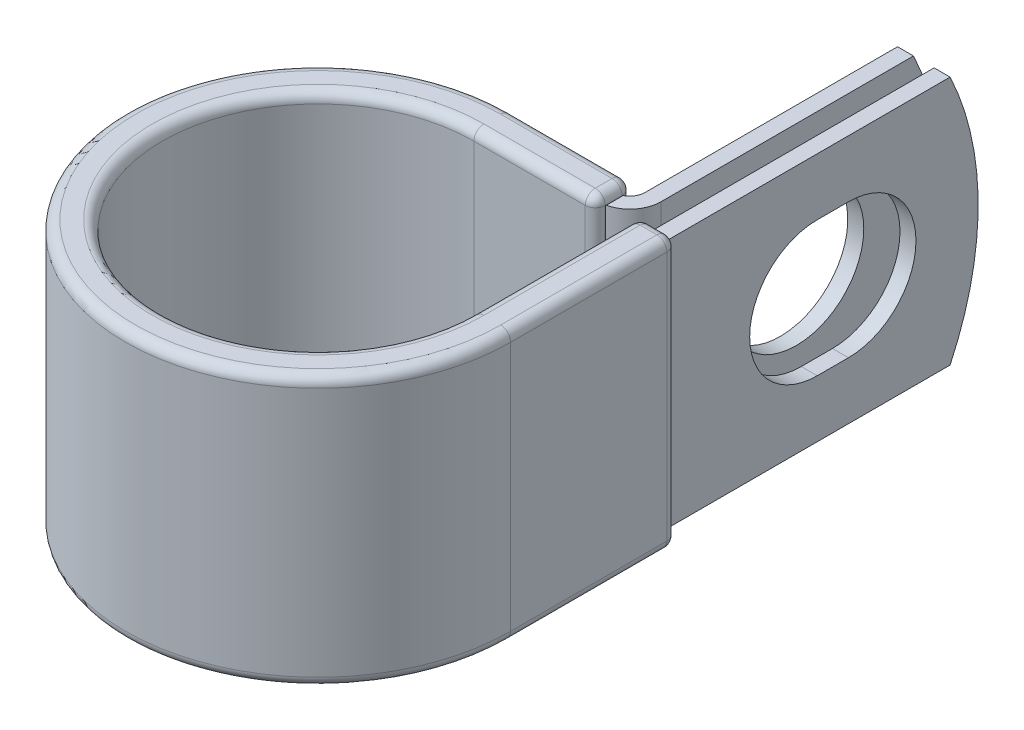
ISO-10303-21;
HEADER;
FILE_DESCRIPTION(('STEP AP214'),'2;1');
FILE_NAME('part.step','',(''),(''),'','','');
FILE_SCHEMA(('AUTOMOTIVE_DESIGN { 1 0 10303 214 1 1 1 1 }'));
ENDSEC;
DATA;
#1=APPLICATION_CONTEXT('core data for automotive mechanical design processes');
#2=APPLICATION_PROTOCOL_DEFINITION('international standard','automotive_design',2000,#1);
#3=PRODUCT_CONTEXT('',#1,'mechanical');
#4=PRODUCT('Part','Part','',(#3));
#5=PRODUCT_RELATED_PRODUCT_CATEGORY('part','',(#4));
#6=PRODUCT_DEFINITION_FORMATION('','',#4);
#7=PRODUCT_DEFINITION_CONTEXT('part definition',#1,'design');
#8=PRODUCT_DEFINITION('design','',#6,#7);
#9=PRODUCT_DEFINITION_SHAPE('','',#8);
#10=(LENGTH_UNIT() NAMED_UNIT(*) SI_UNIT(.MILLI.,.METRE.));
#11=(NAMED_UNIT(*) PLANE_ANGLE_UNIT() SI_UNIT($,.RADIAN.));
#12=(NAMED_UNIT(*) SI_UNIT($,.STERADIAN.) SOLID_ANGLE_UNIT());
#13=UNCERTAINTY_MEASURE_WITH_UNIT(LENGTH_MEASURE(1.E-05),#10,'distance_accuracy_value','');
#14=(GEOMETRIC_REPRESENTATION_CONTEXT(3) GLOBAL_UNCERTAINTY_ASSIGNED_CONTEXT((#13)) GLOBAL_UNIT_ASSIGNED_CONTEXT((#10,
#11,#12)) REPRESENTATION_CONTEXT('',''));
#15=CARTESIAN_POINT('',(0.,0.,0.));
#16=DIRECTION('',(0.,0.,1.));
#17=DIRECTION('',(1.,0.,0.));
#18=AXIS2_PLACEMENT_3D('',#15,#16,#17);
#19=CARTESIAN_POINT('',(11.11885,9.525,-36.4998));
#20=DIRECTION('',(1.,0.,0.));
#21=DIRECTION('',(0.,0.,-1.));
#22=AXIS2_PLACEMENT_3D('',#19,#20,#21);
#23=PLANE('',#22);
#24=CARTESIAN_POINT('',(11.11885,0.,-25.4));
#25=DIRECTION('',(1.,0.,0.));
#26=DIRECTION('',(0.,0.,-1.));
#27=AXIS2_PLACEMENT_3D('',#24,#25,#26);
#28=CIRCLE('',#27,5.1562);
#29=CARTESIAN_POINT('',(11.11885,0.,-30.5562));
#30=VERTEX_POINT('',#29);
#31=EDGE_CURVE('E460',#30,#30,#28,.F.);
#32=ORIENTED_EDGE('',*,*,#31,.T.);
#33=EDGE_LOOP('',(#32));
#34=FACE_BOUND('',#33,.T.);
#35=DIRECTION('',(0.,0.,1.));
#36=VECTOR('',#35,1.);
#37=CARTESIAN_POINT('',(11.11885,-9.525,-36.4998));
#38=LINE('',#37,#36);
#39=CARTESIAN_POINT('',(11.11885,-9.525,-34.3552631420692));
#40=VERTEX_POINT('',#39);
#41=CARTESIAN_POINT('',(11.11885,-9.525,-15.07109));
#42=VERTEX_POINT('',#41);
#43=EDGE_CURVE('E482',#40,#42,#38,.T.);
#44=ORIENTED_EDGE('',*,*,#43,.F.);
#45=CARTESIAN_POINT('',(11.11885,0.,-14.2748));
#46=DIRECTION('',(1.,0.,0.));
#47=DIRECTION('',(0.,0.,-1.));
#48=AXIS2_PLACEMENT_3D('',#45,#46,#47);
#49=CIRCLE('',#48,22.225);
#50=CARTESIAN_POINT('',(11.11885,9.525,-34.3552631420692));
#51=VERTEX_POINT('',#50);
#52=EDGE_CURVE('E419',#40,#51,#49,.T.);
#53=ORIENTED_EDGE('',*,*,#52,.T.);
#54=DIRECTION('',(0.,0.,1.));
#55=VECTOR('',#54,1.);
#56=CARTESIAN_POINT('',(11.11885,9.525,-36.4998));
#57=LINE('',#56,#55);
#58=CARTESIAN_POINT('',(11.11885,9.525,-15.07109));
#59=VERTEX_POINT('',#58);
#60=EDGE_CURVE('E472',#51,#59,#57,.T.);
#61=ORIENTED_EDGE('',*,*,#60,.T.);
#62=DIRECTION('',(0.,-1.,0.));
#63=VECTOR('',#62,1.);
#64=CARTESIAN_POINT('',(11.11885,9.525,-15.07109));
#65=LINE('',#64,#63);
#66=EDGE_CURVE('E489',#59,#42,#65,.T.);
#67=ORIENTED_EDGE('',*,*,#66,.T.);
#68=EDGE_LOOP('',(#44,#53,#61,#67));
#69=FACE_BOUND('',#68,.T.);
#70=ADVANCED_FACE('F54',(#34,#69),#23,.T.);
#71=CARTESIAN_POINT('',(9.89965,9.525,-36.4998));
#72=DIRECTION('',(1.,0.,0.));
#73=DIRECTION('',(0.,0.,-1.));
#74=AXIS2_PLACEMENT_3D('',#71,#72,#73);
#75=PLANE('',#74);
#76=CARTESIAN_POINT('',(9.89965,0.,-25.4));
#77=DIRECTION('',(-1.,0.,0.));
#78=DIRECTION('',(0.,0.,1.));
#79=AXIS2_PLACEMENT_3D('',#76,#77,#78);
#80=CIRCLE('',#79,5.1562);
#81=CARTESIAN_POINT('',(9.89965,0.,-20.2438));
#82=VERTEX_POINT('',#81);
#83=EDGE_CURVE('E457',#82,#82,#80,.T.);
#84=ORIENTED_EDGE('',*,*,#83,.F.);
#85=EDGE_LOOP('',(#84));
#86=FACE_BOUND('',#85,.T.);
#87=CARTESIAN_POINT('',(9.89965,0.,-14.2748));
#88=DIRECTION('',(-1.,0.,0.));
#89=DIRECTION('',(0.,0.,1.));
#90=AXIS2_PLACEMENT_3D('',#87,#88,#89);
#91=CIRCLE('',#90,22.225);
#92=CARTESIAN_POINT('',(9.89965,9.525,-34.3552631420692));
#93=VERTEX_POINT('',#92);
#94=CARTESIAN_POINT('',(9.89965,-9.525,-34.3552631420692));
#95=VERTEX_POINT('',#94);
#96=EDGE_CURVE('E411',#93,#95,#91,.T.);
#97=ORIENTED_EDGE('',*,*,#96,.T.);
#98=DIRECTION('',(0.,0.,1.));
#99=VECTOR('',#98,1.);
#100=CARTESIAN_POINT('',(9.89965,-9.525,-36.4998));
#101=LINE('',#100,#99);
#102=CARTESIAN_POINT('',(9.89965,-9.525,-15.07109));
#103=VERTEX_POINT('',#102);
#104=EDGE_CURVE('E484',#95,#103,#101,.T.);
#105=ORIENTED_EDGE('',*,*,#104,.T.);
#106=DIRECTION('',(0.,-1.,0.));
#107=VECTOR('',#106,1.);
#108=CARTESIAN_POINT('',(9.89965,9.525,-15.07109));
#109=LINE('',#108,#107);
#110=CARTESIAN_POINT('',(9.89965,9.525,-15.07109));
#111=VERTEX_POINT('',#110);
#112=EDGE_CURVE('E477',#111,#103,#109,.T.);
#113=ORIENTED_EDGE('',*,*,#112,.F.);
#114=DIRECTION('',(0.,0.,1.));
#115=VECTOR('',#114,1.);
#116=CARTESIAN_POINT('',(9.89965,9.525,-36.4998));
#117=LINE('',#116,#115);
#118=EDGE_CURVE('E474',#93,#111,#117,.T.);
#119=ORIENTED_EDGE('',*,*,#118,.F.);
#120=EDGE_LOOP('',(#97,#105,#113,#119));
#121=FACE_BOUND('',#120,.T.);
#122=ADVANCED_FACE('F788',(#86,#121),#75,.F.);
#123=CARTESIAN_POINT('',(0.,-9.525,0.));
#124=DIRECTION('',(0.,1.,0.));
#125=DIRECTION('',(1.,0.,0.));
#126=AXIS2_PLACEMENT_3D('',#123,#124,#125);
#127=PLANE('',#126);
#128=CARTESIAN_POINT('',(8.74141000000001,-9.525,-15.07109));
#129=DIRECTION('',(0.,-1.,0.));
#130=DIRECTION('',(0.,0.,1.));
#131=AXIS2_PLACEMENT_3D('',#128,#129,#130);
#132=CIRCLE('',#131,2.37744);
#133=CARTESIAN_POINT('',(9.26465000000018,-9.525,-12.7519434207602));
#134=VERTEX_POINT('',#133);
#135=EDGE_CURVE('E479',#42,#134,#132,.T.);
#136=ORIENTED_EDGE('',*,*,#135,.T.);
#137=DIRECTION('',(0.,0.,-1.));
#138=VECTOR('',#137,1.);
#139=CARTESIAN_POINT('',(9.2646500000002,-9.525,-13.91285));
#140=LINE('',#139,#138);
#141=CARTESIAN_POINT('',(9.2646500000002,-9.525,-13.9446));
#142=VERTEX_POINT('',#141);
#143=EDGE_CURVE('E368',#134,#142,#140,.T.);
#144=ORIENTED_EDGE('',*,*,#143,.T.);
#145=CARTESIAN_POINT('',(8.5026500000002,-9.525,-13.9446));
#146=DIRECTION('',(0.,1.,0.));
#147=DIRECTION('',(0.,0.,1.));
#148=AXIS2_PLACEMENT_3D('',#145,#146,#147);
#149=CIRCLE('',#148,0.762);
#150=CARTESIAN_POINT('',(9.25926105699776,-9.525,-14.0350638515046));
#151=VERTEX_POINT('',#150);
#152=EDGE_CURVE('E554',#142,#151,#149,.T.);
#153=ORIENTED_EDGE('',*,*,#152,.T.);
#154=CARTESIAN_POINT('',(8.74141000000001,-9.525,-15.07109));
#155=DIRECTION('',(0.,1.,0.));
#156=DIRECTION('',(1.,0.,0.));
#157=AXIS2_PLACEMENT_3D('',#154,#155,#156);
#158=CIRCLE('',#157,1.15824);
#159=EDGE_CURVE('E77',#103,#151,#158,.F.);
#160=ORIENTED_EDGE('',*,*,#159,.F.);
#161=ORIENTED_EDGE('',*,*,#104,.F.);
#162=DIRECTION('',(-1.,0.,0.));
#163=VECTOR('',#162,1.);
#164=CARTESIAN_POINT('',(13.91285,-9.525,-34.3552631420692));
#165=LINE('',#164,#163);
#166=EDGE_CURVE('E498',#40,#95,#165,.T.);
#167=ORIENTED_EDGE('',*,*,#166,.F.);
#168=ORIENTED_EDGE('',*,*,#43,.T.);
#169=EDGE_LOOP('',(#136,#144,#153,#160,#161,#167,#168));
#170=FACE_BOUND('',#169,.T.);
#171=ADVANCED_FACE('F794',(#170),#127,.F.);
#172=CARTESIAN_POINT('',(0.,9.525,0.));
#173=DIRECTION('',(0.,1.,0.));
#174=DIRECTION('',(1.,0.,0.));
#175=AXIS2_PLACEMENT_3D('',#172,#173,#174);
#176=PLANE('',#175);
#177=DIRECTION('',(0.,0.,-1.));
#178=VECTOR('',#177,1.);
#179=CARTESIAN_POINT('',(9.26465,9.525,1.29956706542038E-13));
#180=LINE('',#179,#178);
#181=CARTESIAN_POINT('',(9.26465000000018,9.525,-12.7519434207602));
#182=VERTEX_POINT('',#181);
#183=CARTESIAN_POINT('',(9.2646500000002,9.525,-13.9446));
#184=VERTEX_POINT('',#183);
#185=EDGE_CURVE('E405',#182,#184,#180,.T.);
#186=ORIENTED_EDGE('',*,*,#185,.F.);
#187=CARTESIAN_POINT('',(8.74141000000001,9.525,-15.07109));
#188=DIRECTION('',(0.,-1.,0.));
#189=DIRECTION('',(0.,0.,1.));
#190=AXIS2_PLACEMENT_3D('',#187,#188,#189);
#191=CIRCLE('',#190,2.37744);
#192=EDGE_CURVE('E469',#59,#182,#191,.T.);
#193=ORIENTED_EDGE('',*,*,#192,.F.);
#194=ORIENTED_EDGE('',*,*,#60,.F.);
#195=DIRECTION('',(-1.,0.,0.));
#196=VECTOR('',#195,1.);
#197=CARTESIAN_POINT('',(13.91285,9.525,-34.3552631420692));
#198=LINE('',#197,#196);
#199=EDGE_CURVE('E495',#51,#93,#198,.T.);
#200=ORIENTED_EDGE('',*,*,#199,.T.);
#201=ORIENTED_EDGE('',*,*,#118,.T.);
#202=CARTESIAN_POINT('',(8.74141000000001,9.525,-15.07109));
#203=DIRECTION('',(0.,1.,0.));
#204=DIRECTION('',(1.,0.,0.));
#205=AXIS2_PLACEMENT_3D('',#202,#203,#204);
#206=CIRCLE('',#205,1.15824);
#207=CARTESIAN_POINT('',(9.25926105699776,9.525,-14.0350638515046));
#208=VERTEX_POINT('',#207);
#209=EDGE_CURVE('E70',#111,#208,#206,.F.);
#210=ORIENTED_EDGE('',*,*,#209,.T.);
#211=CARTESIAN_POINT('',(8.5026500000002,9.525,-13.9446));
#212=DIRECTION('',(0.,1.,0.));
#213=DIRECTION('',(0.,0.,1.));
#214=AXIS2_PLACEMENT_3D('',#211,#212,#213);
#215=CIRCLE('',#214,0.762);
#216=EDGE_CURVE('E12',#208,#184,#215,.F.);
#217=ORIENTED_EDGE('',*,*,#216,.T.);
#218=EDGE_LOOP('',(#186,#193,#194,#200,#201,#210,#217));
#219=FACE_BOUND('',#218,.T.);
#220=ADVANCED_FACE('F802',(#219),#176,.T.);
#221=CARTESIAN_POINT('',(8.74141000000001,9.525,-15.07109));
#222=DIRECTION('',(0.,-1.,0.));
#223=DIRECTION('',(0.,0.,-1.));
#224=AXIS2_PLACEMENT_3D('',#221,#222,#223);
#225=CYLINDRICAL_SURFACE('',#224,2.37744);
#226=ORIENTED_EDGE('',*,*,#135,.F.);
#227=ORIENTED_EDGE('',*,*,#66,.F.);
#228=ORIENTED_EDGE('',*,*,#192,.T.);
#229=CARTESIAN_POINT('',(8.74141000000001,9.525,-15.07109));
#230=DIRECTION('',(0.,-1.,0.));
#231=DIRECTION('',(0.,0.,-1.));
#232=AXIS2_PLACEMENT_3D('',#229,#230,#231);
#233=CIRCLE('',#232,2.37744);
#234=CARTESIAN_POINT('',(8.74141000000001,9.525,-12.69365));
#235=VERTEX_POINT('',#234);
#236=EDGE_CURVE('E402',#235,#182,#233,.F.);
#237=ORIENTED_EDGE('',*,*,#236,.F.);
#238=DIRECTION('',(0.,-1.,0.));
#239=VECTOR('',#238,1.);
#240=CARTESIAN_POINT('',(8.74141000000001,9.525,-12.69365));
#241=LINE('',#240,#239);
#242=CARTESIAN_POINT('',(8.74141000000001,-9.52499999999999,-12.69365));
#243=VERTEX_POINT('',#242);
#244=EDGE_CURVE('E492',#235,#243,#241,.T.);
#245=ORIENTED_EDGE('',*,*,#244,.T.);
#246=CARTESIAN_POINT('',(8.74141000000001,-9.52499999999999,-15.07109));
#247=DIRECTION('',(0.,1.,0.));
#248=DIRECTION('',(-1.,0.,0.));
#249=AXIS2_PLACEMENT_3D('',#246,#247,#248);
#250=CIRCLE('',#249,2.37744);
#251=EDGE_CURVE('E400',#134,#243,#250,.F.);
#252=ORIENTED_EDGE('',*,*,#251,.F.);
#253=EDGE_LOOP('',(#226,#227,#228,#237,#245,#252));
#254=FACE_BOUND('',#253,.T.);
#255=ADVANCED_FACE('F799',(#254),#225,.T.);
#256=CARTESIAN_POINT('',(8.74141000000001,9.525,-15.07109));
#257=DIRECTION('',(0.,-1.,0.));
#258=DIRECTION('',(0.,0.,-1.));
#259=AXIS2_PLACEMENT_3D('',#256,#257,#258);
#260=CYLINDRICAL_SURFACE('',#259,1.15824);
#261=ORIENTED_EDGE('',*,*,#159,.T.);
#262=DIRECTION('',(0.,1.,0.));
#263=VECTOR('',#262,1.);
#264=CARTESIAN_POINT('',(9.25926105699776,-9.525,-14.0350638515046));
#265=LINE('',#264,#263);
#266=EDGE_CURVE('E63',#151,#208,#265,.T.);
#267=ORIENTED_EDGE('',*,*,#266,.T.);
#268=ORIENTED_EDGE('',*,*,#209,.F.);
#269=ORIENTED_EDGE('',*,*,#112,.T.);
#270=EDGE_LOOP('',(#261,#267,#268,#269));
#271=FACE_BOUND('',#270,.T.);
#272=ADVANCED_FACE('F801',(#271),#260,.F.);
#273=CARTESIAN_POINT('',(25.7027859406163,0.,-25.4));
#274=DIRECTION('',(-1.,0.,0.));
#275=DIRECTION('',(0.,0.,1.));
#276=AXIS2_PLACEMENT_3D('',#273,#274,#275);
#277=CYLINDRICAL_SURFACE('',#276,5.1562);
#278=ORIENTED_EDGE('',*,*,#83,.T.);
#279=EDGE_LOOP('',(#278));
#280=FACE_BOUND('',#279,.T.);
#281=ORIENTED_EDGE('',*,*,#31,.F.);
#282=EDGE_LOOP('',(#281));
#283=FACE_BOUND('',#282,.T.);
#284=ADVANCED_FACE('F808',(#280,#283),#277,.F.);
#285=CARTESIAN_POINT('',(13.91285,0.,-14.2748));
#286=DIRECTION('',(-1.,0.,0.));
#287=DIRECTION('',(0.,0.,1.));
#288=AXIS2_PLACEMENT_3D('',#285,#286,#287);
#289=CYLINDRICAL_SURFACE('',#288,22.225);
#290=ORIENTED_EDGE('',*,*,#52,.F.);
#291=ORIENTED_EDGE('',*,*,#166,.T.);
#292=ORIENTED_EDGE('',*,*,#96,.F.);
#293=ORIENTED_EDGE('',*,*,#199,.F.);
#294=EDGE_LOOP('',(#290,#291,#292,#293));
#295=FACE_BOUND('',#294,.T.);
#296=ADVANCED_FACE('F859',(#295),#289,.T.);
#297=CARTESIAN_POINT('',(1.79790553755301E-13,-9.525,-12.69365));
#298=DIRECTION('',(0.,0.,1.));
#299=DIRECTION('',(1.,0.,0.));
#300=AXIS2_PLACEMENT_3D('',#297,#298,#299);
#301=PLANE('',#300);
#302=DIRECTION('',(1.,0.,0.));
#303=VECTOR('',#302,1.);
#304=CARTESIAN_POINT('',(1.79790553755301E-13,-9.525,-12.69365));
#305=LINE('',#304,#303);
#306=CARTESIAN_POINT('',(9.26465000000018,-9.525,-12.69365));
#307=VERTEX_POINT('',#306);
#308=EDGE_CURVE('E375',#243,#307,#305,.T.);
#309=ORIENTED_EDGE('',*,*,#308,.F.);
#310=ORIENTED_EDGE('',*,*,#244,.F.);
#311=DIRECTION('',(1.,0.,0.));
#312=VECTOR('',#311,1.);
#313=CARTESIAN_POINT('',(1.79790553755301E-13,9.525,-12.69365));
#314=LINE('',#313,#312);
#315=CARTESIAN_POINT('',(9.26465000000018,9.525,-12.69365));
#316=VERTEX_POINT('',#315);
#317=EDGE_CURVE('E377',#235,#316,#314,.T.);
#318=ORIENTED_EDGE('',*,*,#317,.T.);
#319=DIRECTION('',(0.,-1.,0.));
#320=VECTOR('',#319,1.);
#321=CARTESIAN_POINT('',(9.26465000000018,-9.525,-12.69365));
#322=LINE('',#321,#320);
#323=EDGE_CURVE('E307',#316,#307,#322,.T.);
#324=ORIENTED_EDGE('',*,*,#323,.T.);
#325=EDGE_LOOP('',(#309,#310,#318,#324));
#326=FACE_BOUND('',#325,.T.);
#327=ADVANCED_FACE('F831',(#326),#301,.F.);
#328=CARTESIAN_POINT('',(9.26465000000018,-9.55675,-12.6619));
#329=DIRECTION('',(1.,0.,0.));
#330=DIRECTION('',(0.,0.,-1.));
#331=AXIS2_PLACEMENT_3D('',#328,#329,#330);
#332=PLANE('',#331);
#333=DIRECTION('',(0.,0.,-1.));
#334=VECTOR('',#333,1.);
#335=CARTESIAN_POINT('',(9.2646500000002,-9.55675,-13.9446));
#336=LINE('',#335,#334);
#337=CARTESIAN_POINT('',(9.26465000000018,-9.55675,-12.6619));
#338=VERTEX_POINT('',#337);
#339=CARTESIAN_POINT('',(9.2646500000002,-9.55675,-13.9446));
#340=VERTEX_POINT('',#339);
#341=EDGE_CURVE('E508',#338,#340,#336,.T.);
#342=ORIENTED_EDGE('',*,*,#341,.T.);
#343=DIRECTION('',(0.,1.,0.));
#344=VECTOR('',#343,1.);
#345=CARTESIAN_POINT('',(9.2646500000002,-9.55675,-13.9446));
#346=LINE('',#345,#344);
#347=EDGE_CURVE('E512',#340,#142,#346,.T.);
#348=ORIENTED_EDGE('',*,*,#347,.T.);
#349=ORIENTED_EDGE('',*,*,#143,.F.);
#350=EDGE_CURVE('E369',#307,#134,#140,.T.);
#351=ORIENTED_EDGE('',*,*,#350,.F.);
#352=ORIENTED_EDGE('',*,*,#323,.F.);
#353=DIRECTION('',(0.,0.,1.));
#354=VECTOR('',#353,1.);
#355=CARTESIAN_POINT('',(9.26465000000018,9.525,-12.69365));
#356=LINE('',#355,#354);
#357=EDGE_CURVE('E372',#182,#316,#356,.T.);
#358=ORIENTED_EDGE('',*,*,#357,.F.);
#359=ORIENTED_EDGE('',*,*,#185,.T.);
#360=DIRECTION('',(0.,1.,0.));
#361=VECTOR('',#360,1.);
#362=CARTESIAN_POINT('',(9.2646500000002,-9.55675,-13.9446));
#363=LINE('',#362,#361);
#364=CARTESIAN_POINT('',(9.2646500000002,9.55674999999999,-13.9446));
#365=VERTEX_POINT('',#364);
#366=EDGE_CURVE('E510',#184,#365,#363,.T.);
#367=ORIENTED_EDGE('',*,*,#366,.T.);
#368=DIRECTION('',(0.,0.,1.));
#369=VECTOR('',#368,1.);
#370=CARTESIAN_POINT('',(9.26465000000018,9.55674999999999,-12.6619));
#371=LINE('',#370,#369);
#372=CARTESIAN_POINT('',(9.26465000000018,9.55674999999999,-12.6619));
#373=VERTEX_POINT('',#372);
#374=EDGE_CURVE('E504',#365,#373,#371,.T.);
#375=ORIENTED_EDGE('',*,*,#374,.T.);
#376=DIRECTION('',(0.,-1.,0.));
#377=VECTOR('',#376,1.);
#378=CARTESIAN_POINT('',(9.26465000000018,-9.55675,-12.6619));
#379=LINE('',#378,#377);
#380=EDGE_CURVE('E506',#373,#338,#379,.T.);
#381=ORIENTED_EDGE('',*,*,#380,.T.);
#382=EDGE_LOOP('',(#342,#348,#349,#351,#352,#358,#359,#367,#375,#381));
#383=FACE_BOUND('',#382,.T.);
#384=ADVANCED_FACE('F827',(#383),#332,.T.);
#385=CARTESIAN_POINT('',(1.97337826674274E-13,-9.55675,-13.9446));
#386=DIRECTION('',(1.,0.,0.));
#387=DIRECTION('',(0.,0.,-1.));
#388=AXIS2_PLACEMENT_3D('',#385,#386,#387);
#389=CYLINDRICAL_SURFACE('',#388,0.761999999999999);
#390=DIRECTION('',(1.,0.,0.));
#391=VECTOR('',#390,1.);
#392=CARTESIAN_POINT('',(2.08026520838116E-13,-9.55675,-14.7066));
#393=LINE('',#392,#391);
#394=CARTESIAN_POINT('',(2.08026520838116E-13,-9.55675,-14.7066));
#395=VERTEX_POINT('',#394);
#396=CARTESIAN_POINT('',(8.5026500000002,-9.55675,-14.7066));
#397=VERTEX_POINT('',#396);
#398=EDGE_CURVE('E394',#395,#397,#393,.T.);
#399=ORIENTED_EDGE('',*,*,#398,.T.);
#400=CARTESIAN_POINT('',(8.5026500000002,-9.55675,-13.9446));
#401=DIRECTION('',(1.,0.,0.));
#402=DIRECTION('',(0.,0.,-1.));
#403=AXIS2_PLACEMENT_3D('',#400,#401,#402);
#404=CIRCLE('',#403,0.761999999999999);
#405=CARTESIAN_POINT('',(8.5026500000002,-10.31875,-13.9446));
#406=VERTEX_POINT('',#405);
#407=EDGE_CURVE('E517',#397,#406,#404,.F.);
#408=ORIENTED_EDGE('',*,*,#407,.T.);
#409=DIRECTION('',(1.,0.,0.));
#410=VECTOR('',#409,1.);
#411=CARTESIAN_POINT('',(1.97337826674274E-13,-10.31875,-13.9446));
#412=LINE('',#411,#410);
#413=CARTESIAN_POINT('',(1.97337826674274E-13,-10.31875,-13.9446));
#414=VERTEX_POINT('',#413);
#415=EDGE_CURVE('E397',#414,#406,#412,.T.);
#416=ORIENTED_EDGE('',*,*,#415,.F.);
#417=CARTESIAN_POINT('',(1.97337826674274E-13,-9.55675,-13.9446));
#418=DIRECTION('',(1.,0.,0.));
#419=DIRECTION('',(0.,0.,1.));
#420=AXIS2_PLACEMENT_3D('',#417,#418,#419);
#421=CIRCLE('',#420,0.761999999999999);
#422=EDGE_CURVE('E345',#414,#395,#421,.T.);
#423=ORIENTED_EDGE('',*,*,#422,.T.);
#424=EDGE_LOOP('',(#399,#408,#416,#423));
#425=FACE_BOUND('',#424,.T.);
#426=ADVANCED_FACE('F670',(#425),#389,.T.);
#427=CARTESIAN_POINT('',(2.08026520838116E-13,9.55675,-14.7066));
#428=DIRECTION('',(0.,0.,-1.));
#429=DIRECTION('',(-1.,0.,0.));
#430=AXIS2_PLACEMENT_3D('',#427,#428,#429);
#431=PLANE('',#430);
#432=DIRECTION('',(1.,0.,0.));
#433=VECTOR('',#432,1.);
#434=CARTESIAN_POINT('',(2.08026520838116E-13,9.55675,-14.7066));
#435=LINE('',#434,#433);
#436=CARTESIAN_POINT('',(2.08026520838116E-13,9.55675,-14.7066));
#437=VERTEX_POINT('',#436);
#438=CARTESIAN_POINT('',(8.5026500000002,9.55675,-14.7066));
#439=VERTEX_POINT('',#438);
#440=EDGE_CURVE('E391',#437,#439,#435,.T.);
#441=ORIENTED_EDGE('',*,*,#440,.T.);
#442=DIRECTION('',(0.,1.,0.));
#443=VECTOR('',#442,1.);
#444=CARTESIAN_POINT('',(8.5026500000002,9.55675,-14.7066));
#445=LINE('',#444,#443);
#446=EDGE_CURVE('E515',#439,#397,#445,.F.);
#447=ORIENTED_EDGE('',*,*,#446,.T.);
#448=ORIENTED_EDGE('',*,*,#398,.F.);
#449=DIRECTION('',(0.,1.,0.));
#450=VECTOR('',#449,1.);
#451=CARTESIAN_POINT('',(2.08026520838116E-13,9.55675,-14.7066));
#452=LINE('',#451,#450);
#453=EDGE_CURVE('E342',#395,#437,#452,.T.);
#454=ORIENTED_EDGE('',*,*,#453,.T.);
#455=EDGE_LOOP('',(#441,#447,#448,#454));
#456=FACE_BOUND('',#455,.T.);
#457=ADVANCED_FACE('F676',(#456),#431,.T.);
#458=CARTESIAN_POINT('',(1.97337826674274E-13,9.55675,-13.9446));
#459=DIRECTION('',(1.,0.,0.));
#460=DIRECTION('',(0.,0.,-1.));
#461=AXIS2_PLACEMENT_3D('',#458,#459,#460);
#462=CYLINDRICAL_SURFACE('',#461,0.762000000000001);
#463=DIRECTION('',(1.,0.,0.));
#464=VECTOR('',#463,1.);
#465=CARTESIAN_POINT('',(1.97337826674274E-13,10.31875,-13.9446));
#466=LINE('',#465,#464);
#467=CARTESIAN_POINT('',(1.97337826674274E-13,10.31875,-13.9446));
#468=VERTEX_POINT('',#467);
#469=CARTESIAN_POINT('',(8.50265000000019,10.31875,-13.9446));
#470=VERTEX_POINT('',#469);
#471=EDGE_CURVE('E388',#468,#470,#466,.T.);
#472=ORIENTED_EDGE('',*,*,#471,.T.);
#473=CARTESIAN_POINT('',(8.5026500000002,9.55675,-13.9446));
#474=DIRECTION('',(1.,0.,0.));
#475=DIRECTION('',(0.,0.,-1.));
#476=AXIS2_PLACEMENT_3D('',#473,#474,#475);
#477=CIRCLE('',#476,0.762000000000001);
#478=EDGE_CURVE('E501',#470,#439,#477,.F.);
#479=ORIENTED_EDGE('',*,*,#478,.T.);
#480=ORIENTED_EDGE('',*,*,#440,.F.);
#481=CARTESIAN_POINT('',(1.97337826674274E-13,9.55675,-13.9446));
#482=DIRECTION('',(1.,0.,0.));
#483=DIRECTION('',(0.,0.,1.));
#484=AXIS2_PLACEMENT_3D('',#481,#482,#483);
#485=CIRCLE('',#484,0.762000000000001);
#486=EDGE_CURVE('E339',#437,#468,#485,.T.);
#487=ORIENTED_EDGE('',*,*,#486,.T.);
#488=EDGE_LOOP('',(#472,#479,#480,#487));
#489=FACE_BOUND('',#488,.T.);
#490=ADVANCED_FACE('F680',(#489),#462,.T.);
#491=CARTESIAN_POINT('',(1.79345191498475E-13,9.55675,-12.6619));
#492=DIRECTION('',(1.,0.,0.));
#493=DIRECTION('',(0.,0.,-1.));
#494=AXIS2_PLACEMENT_3D('',#491,#492,#493);
#495=CYLINDRICAL_SURFACE('',#494,0.762);
#496=DIRECTION('',(1.,0.,0.));
#497=VECTOR('',#496,1.);
#498=CARTESIAN_POINT('',(1.68656497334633E-13,9.55675,-11.8999));
#499=LINE('',#498,#497);
#500=CARTESIAN_POINT('',(1.68656497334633E-13,9.55675,-11.8999));
#501=VERTEX_POINT('',#500);
#502=CARTESIAN_POINT('',(8.50265000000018,9.55675,-11.8999));
#503=VERTEX_POINT('',#502);
#504=EDGE_CURVE('E382',#501,#503,#499,.T.);
#505=ORIENTED_EDGE('',*,*,#504,.T.);
#506=CARTESIAN_POINT('',(8.50265000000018,9.55675,-12.6619));
#507=DIRECTION('',(1.,0.,0.));
#508=DIRECTION('',(0.,0.,-1.));
#509=AXIS2_PLACEMENT_3D('',#506,#507,#508);
#510=CIRCLE('',#509,0.762);
#511=CARTESIAN_POINT('',(8.50265000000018,10.31875,-12.6619));
#512=VERTEX_POINT('',#511);
#513=EDGE_CURVE('E527',#503,#512,#510,.F.);
#514=ORIENTED_EDGE('',*,*,#513,.T.);
#515=DIRECTION('',(1.,0.,0.));
#516=VECTOR('',#515,1.);
#517=CARTESIAN_POINT('',(1.79345191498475E-13,10.31875,-12.6619));
#518=LINE('',#517,#516);
#519=CARTESIAN_POINT('',(1.79345191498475E-13,10.31875,-12.6619));
#520=VERTEX_POINT('',#519);
#521=EDGE_CURVE('E385',#520,#512,#518,.T.);
#522=ORIENTED_EDGE('',*,*,#521,.F.);
#523=CARTESIAN_POINT('',(1.79345191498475E-13,9.55675,-12.6619));
#524=DIRECTION('',(1.,0.,0.));
#525=DIRECTION('',(0.,0.,1.));
#526=AXIS2_PLACEMENT_3D('',#523,#524,#525);
#527=CIRCLE('',#526,0.762);
#528=EDGE_CURVE('E336',#520,#501,#527,.T.);
#529=ORIENTED_EDGE('',*,*,#528,.T.);
#530=EDGE_LOOP('',(#505,#514,#522,#529));
#531=FACE_BOUND('',#530,.T.);
#532=ADVANCED_FACE('F721',(#531),#495,.T.);
#533=CARTESIAN_POINT('',(1.68656497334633E-13,-9.55675,-11.8999));
#534=DIRECTION('',(0.,0.,1.));
#535=DIRECTION('',(1.,0.,0.));
#536=AXIS2_PLACEMENT_3D('',#533,#534,#535);
#537=PLANE('',#536);
#538=DIRECTION('',(1.,0.,0.));
#539=VECTOR('',#538,1.);
#540=CARTESIAN_POINT('',(1.68656497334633E-13,-9.55675,-11.8999));
#541=LINE('',#540,#539);
#542=CARTESIAN_POINT('',(1.68656497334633E-13,-9.55675,-11.8999));
#543=VERTEX_POINT('',#542);
#544=CARTESIAN_POINT('',(8.50265000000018,-9.55675,-11.8999));
#545=VERTEX_POINT('',#544);
#546=EDGE_CURVE('E379',#543,#545,#541,.T.);
#547=ORIENTED_EDGE('',*,*,#546,.T.);
#548=DIRECTION('',(0.,-1.,0.));
#549=VECTOR('',#548,1.);
#550=CARTESIAN_POINT('',(8.50265000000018,-9.55675,-11.8999));
#551=LINE('',#550,#549);
#552=EDGE_CURVE('E525',#545,#503,#551,.F.);
#553=ORIENTED_EDGE('',*,*,#552,.T.);
#554=ORIENTED_EDGE('',*,*,#504,.F.);
#555=DIRECTION('',(0.,-1.,0.));
#556=VECTOR('',#555,1.);
#557=CARTESIAN_POINT('',(1.68656497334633E-13,-9.55675,-11.8999));
#558=LINE('',#557,#556);
#559=EDGE_CURVE('E327',#501,#543,#558,.T.);
#560=ORIENTED_EDGE('',*,*,#559,.T.);
#561=EDGE_LOOP('',(#547,#553,#554,#560));
#562=FACE_BOUND('',#561,.T.);
#563=ADVANCED_FACE('F719',(#562),#537,.T.);
#564=CARTESIAN_POINT('',(1.79345191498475E-13,-9.55675,-12.6619));
#565=DIRECTION('',(1.,0.,0.));
#566=DIRECTION('',(0.,0.,-1.));
#567=AXIS2_PLACEMENT_3D('',#564,#565,#566);
#568=CYLINDRICAL_SURFACE('',#567,0.762);
#569=DIRECTION('',(1.,0.,0.));
#570=VECTOR('',#569,1.);
#571=CARTESIAN_POINT('',(1.79345191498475E-13,-10.31875,-12.6619));
#572=LINE('',#571,#570);
#573=CARTESIAN_POINT('',(1.79345191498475E-13,-10.31875,-12.6619));
#574=VERTEX_POINT('',#573);
#575=CARTESIAN_POINT('',(8.50265000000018,-10.31875,-12.6619));
#576=VERTEX_POINT('',#575);
#577=EDGE_CURVE('E303',#574,#576,#572,.T.);
#578=ORIENTED_EDGE('',*,*,#577,.T.);
#579=CARTESIAN_POINT('',(8.50265000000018,-9.55675,-12.6619));
#580=DIRECTION('',(1.,0.,0.));
#581=DIRECTION('',(0.,0.,-1.));
#582=AXIS2_PLACEMENT_3D('',#579,#580,#581);
#583=CIRCLE('',#582,0.762);
#584=EDGE_CURVE('E523',#576,#545,#583,.F.);
#585=ORIENTED_EDGE('',*,*,#584,.T.);
#586=ORIENTED_EDGE('',*,*,#546,.F.);
#587=CARTESIAN_POINT('',(1.79345191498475E-13,-9.55675,-12.6619));
#588=DIRECTION('',(1.,0.,0.));
#589=DIRECTION('',(0.,0.,-1.));
#590=AXIS2_PLACEMENT_3D('',#587,#588,#589);
#591=CIRCLE('',#590,0.762);
#592=EDGE_CURVE('E324',#543,#574,#591,.T.);
#593=ORIENTED_EDGE('',*,*,#592,.T.);
#594=EDGE_LOOP('',(#578,#585,#586,#593));
#595=FACE_BOUND('',#594,.T.);
#596=ADVANCED_FACE('F709',(#595),#568,.T.);
#597=CARTESIAN_POINT('',(0.,-9.55675,0.));
#598=DIRECTION('',(0.,-1.,0.));
#599=DIRECTION('',(0.,0.,-1.));
#600=AXIS2_PLACEMENT_3D('',#597,#598,#599);
#601=TOROIDAL_SURFACE('',#600,13.9446,0.761999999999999);
#602=CARTESIAN_POINT('',(13.9446,-9.55675,0.));
#603=DIRECTION('',(0.,0.,1.));
#604=DIRECTION('',(-1.,0.,0.));
#605=AXIS2_PLACEMENT_3D('',#602,#603,#604);
#606=CIRCLE('',#605,0.761999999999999);
#607=CARTESIAN_POINT('',(13.9446,-10.31875,0.));
#608=VERTEX_POINT('',#607);
#609=CARTESIAN_POINT('',(14.7066,-9.55675,0.));
#610=VERTEX_POINT('',#609);
#611=EDGE_CURVE('E318',#608,#610,#606,.T.);
#612=ORIENTED_EDGE('',*,*,#611,.T.);
#613=CARTESIAN_POINT('',(0.,-9.55675,0.));
#614=DIRECTION('',(0.,-1.,0.));
#615=DIRECTION('',(0.,0.,-1.));
#616=AXIS2_PLACEMENT_3D('',#613,#614,#615);
#617=CIRCLE('',#616,14.7066);
#618=EDGE_CURVE('E361',#610,#395,#617,.T.);
#619=ORIENTED_EDGE('',*,*,#618,.T.);
#620=ORIENTED_EDGE('',*,*,#422,.F.);
#621=CARTESIAN_POINT('',(0.,-10.31875,0.));
#622=DIRECTION('',(0.,-1.,0.));
#623=DIRECTION('',(0.,0.,-1.));
#624=AXIS2_PLACEMENT_3D('',#621,#622,#623);
#625=CIRCLE('',#624,13.9446);
#626=EDGE_CURVE('E308',#608,#414,#625,.T.);
#627=ORIENTED_EDGE('',*,*,#626,.F.);
#628=EDGE_LOOP('',(#612,#619,#620,#627));
#629=FACE_BOUND('',#628,.T.);
#630=ADVANCED_FACE('F667',(#629),#601,.T.);
#631=CARTESIAN_POINT('',(0.,9.525,0.));
#632=DIRECTION('',(0.,-1.,0.));
#633=DIRECTION('',(0.,0.,-1.));
#634=AXIS2_PLACEMENT_3D('',#631,#632,#633);
#635=CYLINDRICAL_SURFACE('',#634,14.7066);
#636=DIRECTION('',(0.,1.,0.));
#637=VECTOR('',#636,1.);
#638=CARTESIAN_POINT('',(14.7066,9.55675,0.));
#639=LINE('',#638,#637);
#640=CARTESIAN_POINT('',(14.7066,9.55675,0.));
#641=VERTEX_POINT('',#640);
#642=EDGE_CURVE('E655',#610,#641,#639,.T.);
#643=ORIENTED_EDGE('',*,*,#642,.T.);
#644=CARTESIAN_POINT('',(0.,9.55675,0.));
#645=DIRECTION('',(0.,-1.,0.));
#646=DIRECTION('',(0.,0.,-1.));
#647=AXIS2_PLACEMENT_3D('',#644,#645,#646);
#648=CIRCLE('',#647,14.7066);
#649=EDGE_CURVE('E358',#641,#437,#648,.T.);
#650=ORIENTED_EDGE('',*,*,#649,.T.);
#651=ORIENTED_EDGE('',*,*,#453,.F.);
#652=ORIENTED_EDGE('',*,*,#618,.F.);
#653=EDGE_LOOP('',(#643,#650,#651,#652));
#654=FACE_BOUND('',#653,.T.);
#655=ADVANCED_FACE('F673',(#654),#635,.T.);
#656=CARTESIAN_POINT('',(0.,9.55675,0.));
#657=DIRECTION('',(0.,-1.,0.));
#658=DIRECTION('',(0.,0.,-1.));
#659=AXIS2_PLACEMENT_3D('',#656,#657,#658);
#660=TOROIDAL_SURFACE('',#659,13.9446,0.762000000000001);
#661=CARTESIAN_POINT('',(13.9446,9.55675,0.));
#662=DIRECTION('',(0.,0.,1.));
#663=DIRECTION('',(-1.,0.,0.));
#664=AXIS2_PLACEMENT_3D('',#661,#662,#663);
#665=CIRCLE('',#664,0.762000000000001);
#666=CARTESIAN_POINT('',(13.9446,10.31875,0.));
#667=VERTEX_POINT('',#666);
#668=EDGE_CURVE('E734',#641,#667,#665,.T.);
#669=ORIENTED_EDGE('',*,*,#668,.T.);
#670=CARTESIAN_POINT('',(0.,10.31875,0.));
#671=DIRECTION('',(0.,-1.,0.));
#672=DIRECTION('',(0.,0.,-1.));
#673=AXIS2_PLACEMENT_3D('',#670,#671,#672);
#674=CIRCLE('',#673,13.9446);
#675=EDGE_CURVE('E355',#667,#468,#674,.T.);
#676=ORIENTED_EDGE('',*,*,#675,.T.);
#677=ORIENTED_EDGE('',*,*,#486,.F.);
#678=ORIENTED_EDGE('',*,*,#649,.F.);
#679=EDGE_LOOP('',(#669,#676,#677,#678));
#680=FACE_BOUND('',#679,.T.);
#681=ADVANCED_FACE('F678',(#680),#660,.T.);
#682=CARTESIAN_POINT('',(0.,9.55675,0.));
#683=DIRECTION('',(0.,-1.,0.));
#684=DIRECTION('',(0.,0.,-1.));
#685=AXIS2_PLACEMENT_3D('',#682,#683,#684);
#686=TOROIDAL_SURFACE('',#685,12.6619,0.762);
#687=CARTESIAN_POINT('',(12.6619,9.55675,0.));
#688=DIRECTION('',(0.,0.,1.));
#689=DIRECTION('',(-1.,0.,0.));
#690=AXIS2_PLACEMENT_3D('',#687,#688,#689);
#691=CIRCLE('',#690,0.762);
#692=CARTESIAN_POINT('',(12.6619,10.31875,0.));
#693=VERTEX_POINT('',#692);
#694=CARTESIAN_POINT('',(11.8999,9.55675,0.));
#695=VERTEX_POINT('',#694);
#696=EDGE_CURVE('E730',#693,#695,#691,.T.);
#697=ORIENTED_EDGE('',*,*,#696,.T.);
#698=CARTESIAN_POINT('',(0.,9.55675,0.));
#699=DIRECTION('',(0.,-1.,0.));
#700=DIRECTION('',(0.,0.,-1.));
#701=AXIS2_PLACEMENT_3D('',#698,#699,#700);
#702=CIRCLE('',#701,11.8999);
#703=EDGE_CURVE('E349',#695,#501,#702,.T.);
#704=ORIENTED_EDGE('',*,*,#703,.T.);
#705=ORIENTED_EDGE('',*,*,#528,.F.);
#706=CARTESIAN_POINT('',(0.,10.31875,0.));
#707=DIRECTION('',(0.,-1.,0.));
#708=DIRECTION('',(0.,0.,-1.));
#709=AXIS2_PLACEMENT_3D('',#706,#707,#708);
#710=CIRCLE('',#709,12.6619);
#711=EDGE_CURVE('E352',#693,#520,#710,.T.);
#712=ORIENTED_EDGE('',*,*,#711,.F.);
#713=EDGE_LOOP('',(#697,#704,#705,#712));
#714=FACE_BOUND('',#713,.T.);
#715=ADVANCED_FACE('F728',(#714),#686,.T.);
#716=CARTESIAN_POINT('',(0.,9.525,0.));
#717=DIRECTION('',(0.,-1.,0.));
#718=DIRECTION('',(0.,0.,-1.));
#719=AXIS2_PLACEMENT_3D('',#716,#717,#718);
#720=CYLINDRICAL_SURFACE('',#719,11.8999);
#721=DIRECTION('',(0.,-1.,0.));
#722=VECTOR('',#721,1.);
#723=CARTESIAN_POINT('',(11.8999,-9.55675,0.));
#724=LINE('',#723,#722);
#725=CARTESIAN_POINT('',(11.8999,-9.55675,0.));
#726=VERTEX_POINT('',#725);
#727=EDGE_CURVE('E733',#695,#726,#724,.T.);
#728=ORIENTED_EDGE('',*,*,#727,.T.);
#729=CARTESIAN_POINT('',(0.,-9.55675,0.));
#730=DIRECTION('',(0.,-1.,0.));
#731=DIRECTION('',(0.,0.,-1.));
#732=AXIS2_PLACEMENT_3D('',#729,#730,#731);
#733=CIRCLE('',#732,11.8999);
#734=EDGE_CURVE('E314',#726,#543,#733,.T.);
#735=ORIENTED_EDGE('',*,*,#734,.T.);
#736=ORIENTED_EDGE('',*,*,#559,.F.);
#737=ORIENTED_EDGE('',*,*,#703,.F.);
#738=EDGE_LOOP('',(#728,#735,#736,#737));
#739=FACE_BOUND('',#738,.T.);
#740=ADVANCED_FACE('F726',(#739),#720,.F.);
#741=CARTESIAN_POINT('',(0.,-9.55675,0.));
#742=DIRECTION('',(0.,-1.,0.));
#743=DIRECTION('',(0.,0.,-1.));
#744=AXIS2_PLACEMENT_3D('',#741,#742,#743);
#745=TOROIDAL_SURFACE('',#744,12.6619,0.762);
#746=CARTESIAN_POINT('',(12.6619,-9.55675,0.));
#747=DIRECTION('',(0.,0.,1.));
#748=DIRECTION('',(1.,0.,0.));
#749=AXIS2_PLACEMENT_3D('',#746,#747,#748);
#750=CIRCLE('',#749,0.762);
#751=CARTESIAN_POINT('',(12.6619,-10.31875,0.));
#752=VERTEX_POINT('',#751);
#753=EDGE_CURVE('E311',#726,#752,#750,.T.);
#754=ORIENTED_EDGE('',*,*,#753,.T.);
#755=CARTESIAN_POINT('',(0.,-10.31875,0.));
#756=DIRECTION('',(0.,-1.,0.));
#757=DIRECTION('',(0.,0.,-1.));
#758=AXIS2_PLACEMENT_3D('',#755,#756,#757);
#759=CIRCLE('',#758,12.6619);
#760=EDGE_CURVE('E295',#752,#574,#759,.T.);
#761=ORIENTED_EDGE('',*,*,#760,.T.);
#762=ORIENTED_EDGE('',*,*,#592,.F.);
#763=ORIENTED_EDGE('',*,*,#734,.F.);
#764=EDGE_LOOP('',(#754,#761,#762,#763));
#765=FACE_BOUND('',#764,.T.);
#766=ADVANCED_FACE('F312',(#765),#745,.T.);
#767=CARTESIAN_POINT('',(12.6619,-9.55675,0.));
#768=DIRECTION('',(0.,0.,-1.));
#769=DIRECTION('',(-1.,0.,0.));
#770=AXIS2_PLACEMENT_3D('',#767,#768,#769);
#771=CYLINDRICAL_SURFACE('',#770,0.762);
#772=DIRECTION('',(0.,0.,-1.));
#773=VECTOR('',#772,1.);
#774=CARTESIAN_POINT('',(11.8999,-9.55675,0.));
#775=LINE('',#774,#773);
#776=CARTESIAN_POINT('',(11.8999,-9.55675,-11.93165));
#777=VERTEX_POINT('',#776);
#778=EDGE_CURVE('E741',#726,#777,#775,.T.);
#779=ORIENTED_EDGE('',*,*,#778,.T.);
#780=CARTESIAN_POINT('',(12.6619,-9.55675,-11.93165));
#781=DIRECTION('',(0.,0.,-1.));
#782=DIRECTION('',(-1.,0.,0.));
#783=AXIS2_PLACEMENT_3D('',#780,#781,#782);
#784=CIRCLE('',#783,0.762);
#785=CARTESIAN_POINT('',(12.6619,-10.31875,-11.93165));
#786=VERTEX_POINT('',#785);
#787=EDGE_CURVE('E323',#777,#786,#784,.F.);
#788=ORIENTED_EDGE('',*,*,#787,.T.);
#789=DIRECTION('',(0.,0.,-1.));
#790=VECTOR('',#789,1.);
#791=CARTESIAN_POINT('',(12.6619,-10.31875,0.));
#792=LINE('',#791,#790);
#793=EDGE_CURVE('E300',#752,#786,#792,.T.);
#794=ORIENTED_EDGE('',*,*,#793,.F.);
#795=ORIENTED_EDGE('',*,*,#753,.F.);
#796=EDGE_LOOP('',(#779,#788,#794,#795));
#797=FACE_BOUND('',#796,.T.);
#798=ADVANCED_FACE('F321',(#797),#771,.T.);
#799=CARTESIAN_POINT('',(13.9446,-10.31875,0.));
#800=DIRECTION('',(0.,1.,0.));
#801=DIRECTION('',(0.,0.,1.));
#802=AXIS2_PLACEMENT_3D('',#799,#800,#801);
#803=PLANE('',#802);
#804=ORIENTED_EDGE('',*,*,#415,.T.);
#805=DIRECTION('',(0.,0.,-1.));
#806=VECTOR('',#805,1.);
#807=CARTESIAN_POINT('',(8.50265000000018,-10.31875,-12.6619));
#808=LINE('',#807,#806);
#809=EDGE_CURVE('E521',#406,#576,#808,.F.);
#810=ORIENTED_EDGE('',*,*,#809,.T.);
#811=ORIENTED_EDGE('',*,*,#577,.F.);
#812=ORIENTED_EDGE('',*,*,#760,.F.);
#813=ORIENTED_EDGE('',*,*,#793,.T.);
#814=DIRECTION('',(1.,0.,0.));
#815=VECTOR('',#814,1.);
#816=CARTESIAN_POINT('',(13.9446,-10.31875,-11.93165));
#817=LINE('',#816,#815);
#818=CARTESIAN_POINT('',(13.9446,-10.31875,-11.93165));
#819=VERTEX_POINT('',#818);
#820=EDGE_CURVE('E519',#786,#819,#817,.T.);
#821=ORIENTED_EDGE('',*,*,#820,.T.);
#822=DIRECTION('',(0.,0.,-1.));
#823=VECTOR('',#822,1.);
#824=CARTESIAN_POINT('',(13.9446,-10.31875,0.));
#825=LINE('',#824,#823);
#826=EDGE_CURVE('E325',#608,#819,#825,.T.);
#827=ORIENTED_EDGE('',*,*,#826,.F.);
#828=ORIENTED_EDGE('',*,*,#626,.T.);
#829=EDGE_LOOP('',(#804,#810,#811,#812,#813,#821,#827,#828));
#830=FACE_BOUND('',#829,.T.);
#831=ADVANCED_FACE('F298',(#830),#803,.F.);
#832=CARTESIAN_POINT('',(13.9446,-9.55675,0.));
#833=DIRECTION('',(0.,0.,-1.));
#834=DIRECTION('',(-1.,0.,0.));
#835=AXIS2_PLACEMENT_3D('',#832,#833,#834);
#836=CYLINDRICAL_SURFACE('',#835,0.761999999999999);
#837=ORIENTED_EDGE('',*,*,#826,.T.);
#838=CARTESIAN_POINT('',(13.9446,-9.55675,-11.93165));
#839=DIRECTION('',(0.,0.,-1.));
#840=DIRECTION('',(-1.,0.,0.));
#841=AXIS2_PLACEMENT_3D('',#838,#839,#840);
#842=CIRCLE('',#841,0.761999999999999);
#843=CARTESIAN_POINT('',(14.7066,-9.55675,-11.93165));
#844=VERTEX_POINT('',#843);
#845=EDGE_CURVE('E543',#819,#844,#842,.F.);
#846=ORIENTED_EDGE('',*,*,#845,.T.);
#847=DIRECTION('',(0.,0.,-1.));
#848=VECTOR('',#847,1.);
#849=CARTESIAN_POINT('',(14.7066,-9.55675,0.));
#850=LINE('',#849,#848);
#851=EDGE_CURVE('E330',#610,#844,#850,.T.);
#852=ORIENTED_EDGE('',*,*,#851,.F.);
#853=ORIENTED_EDGE('',*,*,#611,.F.);
#854=EDGE_LOOP('',(#837,#846,#852,#853));
#855=FACE_BOUND('',#854,.T.);
#856=ADVANCED_FACE('F661',(#855),#836,.T.);
#857=CARTESIAN_POINT('',(14.7066,9.55675,0.));
#858=DIRECTION('',(-1.,0.,0.));
#859=DIRECTION('',(0.,-1.,0.));
#860=AXIS2_PLACEMENT_3D('',#857,#858,#859);
#861=PLANE('',#860);
#862=ORIENTED_EDGE('',*,*,#851,.T.);
#863=DIRECTION('',(0.,1.,0.));
#864=VECTOR('',#863,1.);
#865=CARTESIAN_POINT('',(14.7066,9.55675,-11.93165));
#866=LINE('',#865,#864);
#867=CARTESIAN_POINT('',(14.7066,9.55675,-11.93165));
#868=VERTEX_POINT('',#867);
#869=EDGE_CURVE('E532',#844,#868,#866,.T.);
#870=ORIENTED_EDGE('',*,*,#869,.T.);
#871=DIRECTION('',(0.,0.,-1.));
#872=VECTOR('',#871,1.);
#873=CARTESIAN_POINT('',(14.7066,9.55675,0.));
#874=LINE('',#873,#872);
#875=EDGE_CURVE('E640',#641,#868,#874,.T.);
#876=ORIENTED_EDGE('',*,*,#875,.F.);
#877=ORIENTED_EDGE('',*,*,#642,.F.);
#878=EDGE_LOOP('',(#862,#870,#876,#877));
#879=FACE_BOUND('',#878,.T.);
#880=ADVANCED_FACE('F653',(#879),#861,.F.);
#881=CARTESIAN_POINT('',(13.9446,9.55675,0.));
#882=DIRECTION('',(0.,0.,-1.));
#883=DIRECTION('',(-1.,0.,0.));
#884=AXIS2_PLACEMENT_3D('',#881,#882,#883);
#885=CYLINDRICAL_SURFACE('',#884,0.762000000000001);
#886=ORIENTED_EDGE('',*,*,#875,.T.);
#887=CARTESIAN_POINT('',(13.9446,9.55675,-11.93165));
#888=DIRECTION('',(0.,0.,-1.));
#889=DIRECTION('',(-1.,0.,0.));
#890=AXIS2_PLACEMENT_3D('',#887,#888,#889);
#891=CIRCLE('',#890,0.762000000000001);
#892=CARTESIAN_POINT('',(13.9446,10.31875,-11.93165));
#893=VERTEX_POINT('',#892);
#894=EDGE_CURVE('E529',#868,#893,#891,.F.);
#895=ORIENTED_EDGE('',*,*,#894,.T.);
#896=DIRECTION('',(0.,0.,-1.));
#897=VECTOR('',#896,1.);
#898=CARTESIAN_POINT('',(13.9446,10.31875,0.));
#899=LINE('',#898,#897);
#900=EDGE_CURVE('E638',#667,#893,#899,.T.);
#901=ORIENTED_EDGE('',*,*,#900,.F.);
#902=ORIENTED_EDGE('',*,*,#668,.F.);
#903=EDGE_LOOP('',(#886,#895,#901,#902));
#904=FACE_BOUND('',#903,.T.);
#905=ADVANCED_FACE('F636',(#904),#885,.T.);
#906=CARTESIAN_POINT('',(12.6619,10.31875,0.));
#907=DIRECTION('',(0.,-1.,0.));
#908=DIRECTION('',(1.,0.,0.));
#909=AXIS2_PLACEMENT_3D('',#906,#907,#908);
#910=PLANE('',#909);
#911=ORIENTED_EDGE('',*,*,#521,.T.);
#912=DIRECTION('',(0.,0.,1.));
#913=VECTOR('',#912,1.);
#914=CARTESIAN_POINT('',(8.50265000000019,10.31875,-13.9446));
#915=LINE('',#914,#913);
#916=EDGE_CURVE('E552',#512,#470,#915,.F.);
#917=ORIENTED_EDGE('',*,*,#916,.T.);
#918=ORIENTED_EDGE('',*,*,#471,.F.);
#919=ORIENTED_EDGE('',*,*,#675,.F.);
#920=ORIENTED_EDGE('',*,*,#900,.T.);
#921=DIRECTION('',(-1.,0.,0.));
#922=VECTOR('',#921,1.);
#923=CARTESIAN_POINT('',(12.6619,10.31875,-11.93165));
#924=LINE('',#923,#922);
#925=CARTESIAN_POINT('',(12.6619,10.31875,-11.93165));
#926=VERTEX_POINT('',#925);
#927=EDGE_CURVE('E550',#893,#926,#924,.T.);
#928=ORIENTED_EDGE('',*,*,#927,.T.);
#929=DIRECTION('',(0.,0.,-1.));
#930=VECTOR('',#929,1.);
#931=CARTESIAN_POINT('',(12.6619,10.31875,0.));
#932=LINE('',#931,#930);
#933=EDGE_CURVE('E643',#693,#926,#932,.T.);
#934=ORIENTED_EDGE('',*,*,#933,.F.);
#935=ORIENTED_EDGE('',*,*,#711,.T.);
#936=EDGE_LOOP('',(#911,#917,#918,#919,#920,#928,#934,#935));
#937=FACE_BOUND('',#936,.T.);
#938=ADVANCED_FACE('F641',(#937),#910,.F.);
#939=CARTESIAN_POINT('',(12.6619,9.55675,0.));
#940=DIRECTION('',(0.,0.,-1.));
#941=DIRECTION('',(-1.,0.,0.));
#942=AXIS2_PLACEMENT_3D('',#939,#940,#941);
#943=CYLINDRICAL_SURFACE('',#942,0.762);
#944=ORIENTED_EDGE('',*,*,#933,.T.);
#945=CARTESIAN_POINT('',(12.6619,9.55675,-11.93165));
#946=DIRECTION('',(0.,0.,-1.));
#947=DIRECTION('',(-1.,0.,0.));
#948=AXIS2_PLACEMENT_3D('',#945,#946,#947);
#949=CIRCLE('',#948,0.762);
#950=CARTESIAN_POINT('',(11.8999,9.55675,-11.93165));
#951=VERTEX_POINT('',#950);
#952=EDGE_CURVE('E548',#926,#951,#949,.F.);
#953=ORIENTED_EDGE('',*,*,#952,.T.);
#954=DIRECTION('',(0.,0.,-1.));
#955=VECTOR('',#954,1.);
#956=CARTESIAN_POINT('',(11.8999,9.55675,0.));
#957=LINE('',#956,#955);
#958=EDGE_CURVE('E646',#695,#951,#957,.T.);
#959=ORIENTED_EDGE('',*,*,#958,.F.);
#960=ORIENTED_EDGE('',*,*,#696,.F.);
#961=EDGE_LOOP('',(#944,#953,#959,#960));
#962=FACE_BOUND('',#961,.T.);
#963=ADVANCED_FACE('F738',(#962),#943,.T.);
#964=CARTESIAN_POINT('',(12.69365,9.525,0.));
#965=DIRECTION('',(0.,-1.,0.));
#966=DIRECTION('',(0.,0.,-1.));
#967=AXIS2_PLACEMENT_3D('',#964,#965,#966);
#968=PLANE('',#967);
#969=ORIENTED_EDGE('',*,*,#317,.F.);
#970=ORIENTED_EDGE('',*,*,#236,.T.);
#971=ORIENTED_EDGE('',*,*,#357,.T.);
#972=EDGE_LOOP('',(#969,#970,#971));
#973=FACE_BOUND('',#972,.T.);
#974=ADVANCED_FACE('F825',(#973),#968,.T.);
#975=CARTESIAN_POINT('',(13.91285,-9.525,0.));
#976=DIRECTION('',(0.,1.,0.));
#977=DIRECTION('',(-1.,0.,0.));
#978=AXIS2_PLACEMENT_3D('',#975,#976,#977);
#979=PLANE('',#978);
#980=ORIENTED_EDGE('',*,*,#350,.T.);
#981=ORIENTED_EDGE('',*,*,#251,.T.);
#982=ORIENTED_EDGE('',*,*,#308,.T.);
#983=EDGE_LOOP('',(#980,#981,#982));
#984=FACE_BOUND('',#983,.T.);
#985=ADVANCED_FACE('F833',(#984),#979,.T.);
#986=CARTESIAN_POINT('',(11.8999,-9.55675,0.));
#987=DIRECTION('',(1.,0.,0.));
#988=DIRECTION('',(0.,1.,0.));
#989=AXIS2_PLACEMENT_3D('',#986,#987,#988);
#990=PLANE('',#989);
#991=ORIENTED_EDGE('',*,*,#958,.T.);
#992=DIRECTION('',(0.,-1.,0.));
#993=VECTOR('',#992,1.);
#994=CARTESIAN_POINT('',(11.8999,-9.55675,-11.93165));
#995=LINE('',#994,#993);
#996=EDGE_CURVE('E546',#951,#777,#995,.T.);
#997=ORIENTED_EDGE('',*,*,#996,.T.);
#998=ORIENTED_EDGE('',*,*,#778,.F.);
#999=ORIENTED_EDGE('',*,*,#727,.F.);
#1000=EDGE_LOOP('',(#991,#997,#998,#999));
#1001=FACE_BOUND('',#1000,.T.);
#1002=ADVANCED_FACE('F743',(#1001),#990,.F.);
#1003=CARTESIAN_POINT('',(12.6619,-9.55675,-12.69365));
#1004=DIRECTION('',(0.,0.,1.));
#1005=DIRECTION('',(1.,0.,0.));
#1006=AXIS2_PLACEMENT_3D('',#1003,#1004,#1005);
#1007=PLANE('',#1006);
#1008=DIRECTION('',(-1.,0.,0.));
#1009=VECTOR('',#1008,1.);
#1010=CARTESIAN_POINT('',(12.6619,9.55675,-12.69365));
#1011=LINE('',#1010,#1009);
#1012=CARTESIAN_POINT('',(12.6619,9.55675,-12.69365));
#1013=VERTEX_POINT('',#1012);
#1014=CARTESIAN_POINT('',(13.9446,9.55675,-12.69365));
#1015=VERTEX_POINT('',#1014);
#1016=EDGE_CURVE('E534',#1013,#1015,#1011,.F.);
#1017=ORIENTED_EDGE('',*,*,#1016,.T.);
#1018=DIRECTION('',(0.,1.,0.));
#1019=VECTOR('',#1018,1.);
#1020=CARTESIAN_POINT('',(13.9446,-9.55675,-12.69365));
#1021=LINE('',#1020,#1019);
#1022=CARTESIAN_POINT('',(13.9446,-9.55675,-12.69365));
#1023=VERTEX_POINT('',#1022);
#1024=EDGE_CURVE('E540',#1015,#1023,#1021,.F.);
#1025=ORIENTED_EDGE('',*,*,#1024,.T.);
#1026=DIRECTION('',(1.,0.,0.));
#1027=VECTOR('',#1026,1.);
#1028=CARTESIAN_POINT('',(12.6619,-9.55675,-12.69365));
#1029=LINE('',#1028,#1027);
#1030=CARTESIAN_POINT('',(12.6619,-9.55675,-12.69365));
#1031=VERTEX_POINT('',#1030);
#1032=EDGE_CURVE('E538',#1023,#1031,#1029,.F.);
#1033=ORIENTED_EDGE('',*,*,#1032,.T.);
#1034=DIRECTION('',(0.,-1.,0.));
#1035=VECTOR('',#1034,1.);
#1036=CARTESIAN_POINT('',(12.6619,-9.55675,-12.69365));
#1037=LINE('',#1036,#1035);
#1038=EDGE_CURVE('E536',#1031,#1013,#1037,.F.);
#1039=ORIENTED_EDGE('',*,*,#1038,.T.);
#1040=EDGE_LOOP('',(#1017,#1025,#1033,#1039));
#1041=FACE_BOUND('',#1040,.T.);
#1042=DIRECTION('',(0.,-1.,0.));
#1043=VECTOR('',#1042,1.);
#1044=CARTESIAN_POINT('',(12.69365,-9.525,-12.69365));
#1045=LINE('',#1044,#1043);
#1046=CARTESIAN_POINT('',(12.69365,9.525,-12.69365));
#1047=VERTEX_POINT('',#1046);
#1048=CARTESIAN_POINT('',(12.69365,-9.525,-12.69365));
#1049=VERTEX_POINT('',#1048);
#1050=EDGE_CURVE('E580',#1047,#1049,#1045,.T.);
#1051=ORIENTED_EDGE('',*,*,#1050,.T.);
#1052=DIRECTION('',(1.,0.,0.));
#1053=VECTOR('',#1052,1.);
#1054=CARTESIAN_POINT('',(13.91285,-9.525,-12.69365));
#1055=LINE('',#1054,#1053);
#1056=CARTESIAN_POINT('',(13.91285,-9.525,-12.69365));
#1057=VERTEX_POINT('',#1056);
#1058=EDGE_CURVE('E319',#1049,#1057,#1055,.T.);
#1059=ORIENTED_EDGE('',*,*,#1058,.T.);
#1060=DIRECTION('',(0.,1.,0.));
#1061=VECTOR('',#1060,1.);
#1062=CARTESIAN_POINT('',(13.91285,9.525,-12.69365));
#1063=LINE('',#1062,#1061);
#1064=CARTESIAN_POINT('',(13.91285,9.525,-12.69365));
#1065=VERTEX_POINT('',#1064);
#1066=EDGE_CURVE('E751',#1057,#1065,#1063,.T.);
#1067=ORIENTED_EDGE('',*,*,#1066,.T.);
#1068=DIRECTION('',(-1.,0.,0.));
#1069=VECTOR('',#1068,1.);
#1070=CARTESIAN_POINT('',(12.69365,9.525,-12.69365));
#1071=LINE('',#1070,#1069);
#1072=EDGE_CURVE('E749',#1065,#1047,#1071,.T.);
#1073=ORIENTED_EDGE('',*,*,#1072,.T.);
#1074=EDGE_LOOP('',(#1051,#1059,#1067,#1073));
#1075=FACE_BOUND('',#1074,.T.);
#1076=ADVANCED_FACE('F613',(#1041,#1075),#1007,.F.);
#1077=CARTESIAN_POINT('',(-3.66592193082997,5.1562,-24.2061999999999));
#1078=DIRECTION('',(0.,1.,0.));
#1079=DIRECTION('',(0.,0.,1.));
#1080=AXIS2_PLACEMENT_3D('',#1077,#1078,#1079);
#1081=PLANE('',#1080);
#1082=DIRECTION('',(1.,0.,0.));
#1083=VECTOR('',#1082,1.);
#1084=CARTESIAN_POINT('',(-3.66592193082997,5.1562,-26.5938000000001));
#1085=LINE('',#1084,#1083);
#1086=CARTESIAN_POINT('',(12.69365,5.1562,-26.5938000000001));
#1087=VERTEX_POINT('',#1086);
#1088=CARTESIAN_POINT('',(13.91285,5.1562,-26.5938000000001));
#1089=VERTEX_POINT('',#1088);
#1090=EDGE_CURVE('E448',#1087,#1089,#1085,.T.);
#1091=ORIENTED_EDGE('',*,*,#1090,.T.);
#1092=DIRECTION('',(0.,0.,1.));
#1093=VECTOR('',#1092,1.);
#1094=CARTESIAN_POINT('',(13.91285,5.1562,-24.2061999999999));
#1095=LINE('',#1094,#1093);
#1096=CARTESIAN_POINT('',(13.91285,5.1562,-24.2061999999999));
#1097=VERTEX_POINT('',#1096);
#1098=EDGE_CURVE('E426',#1089,#1097,#1095,.T.);
#1099=ORIENTED_EDGE('',*,*,#1098,.T.);
#1100=DIRECTION('',(1.,0.,0.));
#1101=VECTOR('',#1100,1.);
#1102=CARTESIAN_POINT('',(-3.66592193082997,5.1562,-24.2061999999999));
#1103=LINE('',#1102,#1101);
#1104=CARTESIAN_POINT('',(12.69365,5.1562,-24.2061999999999));
#1105=VERTEX_POINT('',#1104);
#1106=EDGE_CURVE('E444',#1105,#1097,#1103,.T.);
#1107=ORIENTED_EDGE('',*,*,#1106,.F.);
#1108=DIRECTION('',(0.,0.,1.));
#1109=VECTOR('',#1108,1.);
#1110=CARTESIAN_POINT('',(12.69365,5.1562,-24.2061999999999));
#1111=LINE('',#1110,#1109);
#1112=EDGE_CURVE('E445',#1087,#1105,#1111,.T.);
#1113=ORIENTED_EDGE('',*,*,#1112,.F.);
#1114=EDGE_LOOP('',(#1091,#1099,#1107,#1113));
#1115=FACE_BOUND('',#1114,.T.);
#1116=ADVANCED_FACE('F879',(#1115),#1081,.F.);
#1117=CARTESIAN_POINT('',(-3.66592193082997,0.,-24.2061999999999));
#1118=DIRECTION('',(1.,0.,0.));
#1119=DIRECTION('',(0.,0.,-1.));
#1120=AXIS2_PLACEMENT_3D('',#1117,#1118,#1119);
#1121=CYLINDRICAL_SURFACE('',#1120,5.1562);
#1122=ORIENTED_EDGE('',*,*,#1106,.T.);
#1123=CARTESIAN_POINT('',(13.91285,0.,-24.2061999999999));
#1124=DIRECTION('',(1.,0.,0.));
#1125=DIRECTION('',(0.,0.,-1.));
#1126=AXIS2_PLACEMENT_3D('',#1123,#1124,#1125);
#1127=CIRCLE('',#1126,5.1562);
#1128=CARTESIAN_POINT('',(13.91285,-5.1562,-24.2061999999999));
#1129=VERTEX_POINT('',#1128);
#1130=EDGE_CURVE('E425',#1097,#1129,#1127,.T.);
#1131=ORIENTED_EDGE('',*,*,#1130,.T.);
#1132=DIRECTION('',(1.,0.,0.));
#1133=VECTOR('',#1132,1.);
#1134=CARTESIAN_POINT('',(-3.66592193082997,-5.1562,-24.2061999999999));
#1135=LINE('',#1134,#1133);
#1136=CARTESIAN_POINT('',(12.69365,-5.1562,-24.2061999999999));
#1137=VERTEX_POINT('',#1136);
#1138=EDGE_CURVE('E443',#1137,#1129,#1135,.T.);
#1139=ORIENTED_EDGE('',*,*,#1138,.F.);
#1140=CARTESIAN_POINT('',(12.69365,0.,-24.2061999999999));
#1141=DIRECTION('',(-1.,0.,0.));
#1142=DIRECTION('',(0.,0.,1.));
#1143=AXIS2_PLACEMENT_3D('',#1140,#1141,#1142);
#1144=CIRCLE('',#1143,5.1562);
#1145=EDGE_CURVE('E440',#1105,#1137,#1144,.F.);
#1146=ORIENTED_EDGE('',*,*,#1145,.F.);
#1147=EDGE_LOOP('',(#1122,#1131,#1139,#1146));
#1148=FACE_BOUND('',#1147,.T.);
#1149=ADVANCED_FACE('F875',(#1148),#1121,.F.);
#1150=CARTESIAN_POINT('',(-3.66592193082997,-5.1562,-24.2061999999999));
#1151=DIRECTION('',(0.,-1.,0.));
#1152=DIRECTION('',(0.,0.,-1.));
#1153=AXIS2_PLACEMENT_3D('',#1150,#1151,#1152);
#1154=PLANE('',#1153);
#1155=ORIENTED_EDGE('',*,*,#1138,.T.);
#1156=DIRECTION('',(0.,0.,-1.));
#1157=VECTOR('',#1156,1.);
#1158=CARTESIAN_POINT('',(13.91285,-5.1562,-24.2061999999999));
#1159=LINE('',#1158,#1157);
#1160=CARTESIAN_POINT('',(13.91285,-5.1562,-26.5938000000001));
#1161=VERTEX_POINT('',#1160);
#1162=EDGE_CURVE('E432',#1129,#1161,#1159,.T.);
#1163=ORIENTED_EDGE('',*,*,#1162,.T.);
#1164=DIRECTION('',(1.,0.,0.));
#1165=VECTOR('',#1164,1.);
#1166=CARTESIAN_POINT('',(-3.66592193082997,-5.1562,-26.5938000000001));
#1167=LINE('',#1166,#1165);
#1168=CARTESIAN_POINT('',(12.69365,-5.1562,-26.5938000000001));
#1169=VERTEX_POINT('',#1168);
#1170=EDGE_CURVE('E439',#1169,#1161,#1167,.T.);
#1171=ORIENTED_EDGE('',*,*,#1170,.F.);
#1172=DIRECTION('',(0.,0.,-1.));
#1173=VECTOR('',#1172,1.);
#1174=CARTESIAN_POINT('',(12.69365,-5.1562,-24.2061999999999));
#1175=LINE('',#1174,#1173);
#1176=EDGE_CURVE('E428',#1137,#1169,#1175,.T.);
#1177=ORIENTED_EDGE('',*,*,#1176,.F.);
#1178=EDGE_LOOP('',(#1155,#1163,#1171,#1177));
#1179=FACE_BOUND('',#1178,.T.);
#1180=ADVANCED_FACE('F878',(#1179),#1154,.F.);
#1181=CARTESIAN_POINT('',(-3.66592193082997,0.,-26.5937999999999));
#1182=DIRECTION('',(1.,0.,0.));
#1183=DIRECTION('',(0.,0.,-1.));
#1184=AXIS2_PLACEMENT_3D('',#1181,#1182,#1183);
#1185=CYLINDRICAL_SURFACE('',#1184,5.1562);
#1186=ORIENTED_EDGE('',*,*,#1170,.T.);
#1187=CARTESIAN_POINT('',(13.91285,0.,-26.5937999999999));
#1188=DIRECTION('',(1.,0.,0.));
#1189=DIRECTION('',(0.,0.,-1.));
#1190=AXIS2_PLACEMENT_3D('',#1187,#1188,#1189);
#1191=CIRCLE('',#1190,5.1562);
#1192=EDGE_CURVE('E429',#1161,#1089,#1191,.T.);
#1193=ORIENTED_EDGE('',*,*,#1192,.T.);
#1194=ORIENTED_EDGE('',*,*,#1090,.F.);
#1195=CARTESIAN_POINT('',(12.69365,0.,-26.5937999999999));
#1196=DIRECTION('',(-1.,0.,0.));
#1197=DIRECTION('',(0.,0.,1.));
#1198=AXIS2_PLACEMENT_3D('',#1195,#1196,#1197);
#1199=CIRCLE('',#1198,5.1562);
#1200=EDGE_CURVE('E449',#1169,#1087,#1199,.F.);
#1201=ORIENTED_EDGE('',*,*,#1200,.F.);
#1202=EDGE_LOOP('',(#1186,#1193,#1194,#1201));
#1203=FACE_BOUND('',#1202,.T.);
#1204=ADVANCED_FACE('F884',(#1203),#1185,.F.);
#1205=DIRECTION('',(-1.,0.,0.));
#1206=VECTOR('',#1205,1.);
#1207=CARTESIAN_POINT('',(13.91285,9.525,-34.3552631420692));
#1208=LINE('',#1207,#1206);
#1209=CARTESIAN_POINT('',(13.91285,9.525,-34.3552631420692));
#1210=VERTEX_POINT('',#1209);
#1211=CARTESIAN_POINT('',(12.69365,9.525,-34.3552631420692));
#1212=VERTEX_POINT('',#1211);
#1213=EDGE_CURVE('E415',#1210,#1212,#1208,.T.);
#1214=ORIENTED_EDGE('',*,*,#1213,.F.);
#1215=CARTESIAN_POINT('',(13.91285,0.,-14.2748));
#1216=DIRECTION('',(-1.,0.,0.));
#1217=DIRECTION('',(0.,0.,1.));
#1218=AXIS2_PLACEMENT_3D('',#1215,#1216,#1217);
#1219=CIRCLE('',#1218,22.225);
#1220=CARTESIAN_POINT('',(13.91285,-9.525,-34.3552631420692));
#1221=VERTEX_POINT('',#1220);
#1222=EDGE_CURVE('E412',#1210,#1221,#1219,.T.);
#1223=ORIENTED_EDGE('',*,*,#1222,.T.);
#1224=DIRECTION('',(-1.,0.,0.));
#1225=VECTOR('',#1224,1.);
#1226=CARTESIAN_POINT('',(13.91285,-9.525,-34.3552631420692));
#1227=LINE('',#1226,#1225);
#1228=CARTESIAN_POINT('',(12.69365,-9.525,-34.3552631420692));
#1229=VERTEX_POINT('',#1228);
#1230=EDGE_CURVE('E408',#1221,#1229,#1227,.T.);
#1231=ORIENTED_EDGE('',*,*,#1230,.T.);
#1232=CARTESIAN_POINT('',(12.69365,0.,-14.2748));
#1233=DIRECTION('',(-1.,0.,0.));
#1234=DIRECTION('',(0.,0.,1.));
#1235=AXIS2_PLACEMENT_3D('',#1232,#1233,#1234);
#1236=CIRCLE('',#1235,22.225);
#1237=EDGE_CURVE('E422',#1212,#1229,#1236,.T.);
#1238=ORIENTED_EDGE('',*,*,#1237,.F.);
#1239=EDGE_LOOP('',(#1214,#1223,#1231,#1238));
#1240=FACE_BOUND('',#1239,.T.);
#1241=ADVANCED_FACE('F769',(#1240),#289,.T.);
#1242=DIRECTION('',(0.,0.,-1.));
#1243=VECTOR('',#1242,1.);
#1244=CARTESIAN_POINT('',(12.69365,9.525,-12.69365));
#1245=LINE('',#1244,#1243);
#1246=EDGE_CURVE('E466',#1047,#1212,#1245,.T.);
#1247=ORIENTED_EDGE('',*,*,#1246,.F.);
#1248=ORIENTED_EDGE('',*,*,#1072,.F.);
#1249=DIRECTION('',(0.,0.,-1.));
#1250=VECTOR('',#1249,1.);
#1251=CARTESIAN_POINT('',(13.91285,9.525,-12.69365));
#1252=LINE('',#1251,#1250);
#1253=EDGE_CURVE('E464',#1065,#1210,#1252,.T.);
#1254=ORIENTED_EDGE('',*,*,#1253,.T.);
#1255=ORIENTED_EDGE('',*,*,#1213,.T.);
#1256=EDGE_LOOP('',(#1247,#1248,#1254,#1255));
#1257=FACE_BOUND('',#1256,.T.);
#1258=ADVANCED_FACE('F772',(#1257),#176,.T.);
#1259=ORIENTED_EDGE('',*,*,#1058,.F.);
#1260=DIRECTION('',(0.,0.,-1.));
#1261=VECTOR('',#1260,1.);
#1262=CARTESIAN_POINT('',(12.69365,-9.525,0.));
#1263=LINE('',#1262,#1261);
#1264=EDGE_CURVE('E463',#1049,#1229,#1263,.T.);
#1265=ORIENTED_EDGE('',*,*,#1264,.T.);
#1266=ORIENTED_EDGE('',*,*,#1230,.F.);
#1267=DIRECTION('',(0.,0.,-1.));
#1268=VECTOR('',#1267,1.);
#1269=CARTESIAN_POINT('',(13.91285,-9.525,0.));
#1270=LINE('',#1269,#1268);
#1271=EDGE_CURVE('E467',#1057,#1221,#1270,.T.);
#1272=ORIENTED_EDGE('',*,*,#1271,.F.);
#1273=EDGE_LOOP('',(#1259,#1265,#1266,#1272));
#1274=FACE_BOUND('',#1273,.T.);
#1275=ADVANCED_FACE('F765',(#1274),#127,.F.);
#1276=CARTESIAN_POINT('',(13.91285,9.525,0.));
#1277=DIRECTION('',(-1.,0.,0.));
#1278=DIRECTION('',(0.,0.,1.));
#1279=AXIS2_PLACEMENT_3D('',#1276,#1277,#1278);
#1280=PLANE('',#1279);
#1281=ORIENTED_EDGE('',*,*,#1192,.F.);
#1282=ORIENTED_EDGE('',*,*,#1162,.F.);
#1283=ORIENTED_EDGE('',*,*,#1130,.F.);
#1284=ORIENTED_EDGE('',*,*,#1098,.F.);
#1285=EDGE_LOOP('',(#1281,#1282,#1283,#1284));
#1286=FACE_BOUND('',#1285,.T.);
#1287=ORIENTED_EDGE('',*,*,#1066,.F.);
#1288=ORIENTED_EDGE('',*,*,#1271,.T.);
#1289=ORIENTED_EDGE('',*,*,#1222,.F.);
#1290=ORIENTED_EDGE('',*,*,#1253,.F.);
#1291=EDGE_LOOP('',(#1287,#1288,#1289,#1290));
#1292=FACE_BOUND('',#1291,.T.);
#1293=ADVANCED_FACE('F762',(#1286,#1292),#1280,.F.);
#1294=CARTESIAN_POINT('',(12.69365,9.525,0.));
#1295=DIRECTION('',(-1.,0.,0.));
#1296=DIRECTION('',(0.,0.,1.));
#1297=AXIS2_PLACEMENT_3D('',#1294,#1295,#1296);
#1298=PLANE('',#1297);
#1299=ORIENTED_EDGE('',*,*,#1176,.T.);
#1300=ORIENTED_EDGE('',*,*,#1200,.T.);
#1301=ORIENTED_EDGE('',*,*,#1112,.T.);
#1302=ORIENTED_EDGE('',*,*,#1145,.T.);
#1303=EDGE_LOOP('',(#1299,#1300,#1301,#1302));
#1304=FACE_BOUND('',#1303,.T.);
#1305=ORIENTED_EDGE('',*,*,#1264,.F.);
#1306=ORIENTED_EDGE('',*,*,#1050,.F.);
#1307=ORIENTED_EDGE('',*,*,#1246,.T.);
#1308=ORIENTED_EDGE('',*,*,#1237,.T.);
#1309=EDGE_LOOP('',(#1305,#1306,#1307,#1308));
#1310=FACE_BOUND('',#1309,.T.);
#1311=ADVANCED_FACE('F774',(#1304,#1310),#1298,.T.);
#1312=CARTESIAN_POINT('',(8.50265000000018,-9.55675,-12.6619));
#1313=DIRECTION('',(0.,0.,1.));
#1314=DIRECTION('',(1.,0.,0.));
#1315=AXIS2_PLACEMENT_3D('',#1312,#1313,#1314);
#1316=SPHERICAL_SURFACE('',#1315,0.762);
#1317=CARTESIAN_POINT('',(8.50265000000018,-9.55675,-12.6619));
#1318=DIRECTION('',(0.,1.,0.));
#1319=DIRECTION('',(0.,0.,1.));
#1320=AXIS2_PLACEMENT_3D('',#1317,#1318,#1319);
#1321=CIRCLE('',#1320,0.762);
#1322=EDGE_CURVE('E574',#545,#338,#1321,.T.);
#1323=ORIENTED_EDGE('',*,*,#1322,.F.);
#1324=ORIENTED_EDGE('',*,*,#584,.F.);
#1325=CARTESIAN_POINT('',(8.50265000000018,-9.55675,-12.6619));
#1326=DIRECTION('',(0.,0.,-1.));
#1327=DIRECTION('',(-1.,0.,0.));
#1328=AXIS2_PLACEMENT_3D('',#1325,#1326,#1327);
#1329=CIRCLE('',#1328,0.762);
#1330=EDGE_CURVE('E577',#338,#576,#1329,.T.);
#1331=ORIENTED_EDGE('',*,*,#1330,.F.);
#1332=EDGE_LOOP('',(#1323,#1324,#1331));
#1333=FACE_BOUND('',#1332,.T.);
#1334=ADVANCED_FACE('F712',(#1333),#1316,.T.);
#1335=CARTESIAN_POINT('',(8.50265000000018,-9.55675,-12.6619));
#1336=DIRECTION('',(0.,0.,1.));
#1337=DIRECTION('',(1.,0.,0.));
#1338=AXIS2_PLACEMENT_3D('',#1335,#1336,#1337);
#1339=CYLINDRICAL_SURFACE('',#1338,0.762);
#1340=ORIENTED_EDGE('',*,*,#1330,.T.);
#1341=ORIENTED_EDGE('',*,*,#809,.F.);
#1342=CARTESIAN_POINT('',(8.5026500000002,-9.55675,-13.9446));
#1343=DIRECTION('',(0.,0.,-1.));
#1344=DIRECTION('',(-1.,0.,0.));
#1345=AXIS2_PLACEMENT_3D('',#1342,#1343,#1344);
#1346=CIRCLE('',#1345,0.762);
#1347=EDGE_CURVE('E571',#340,#406,#1346,.T.);
#1348=ORIENTED_EDGE('',*,*,#1347,.F.);
#1349=ORIENTED_EDGE('',*,*,#341,.F.);
#1350=EDGE_LOOP('',(#1340,#1341,#1348,#1349));
#1351=FACE_BOUND('',#1350,.T.);
#1352=ADVANCED_FACE('F705',(#1351),#1339,.T.);
#1353=CARTESIAN_POINT('',(8.50265000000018,-9.55675,-12.6619));
#1354=DIRECTION('',(0.,-1.,0.));
#1355=DIRECTION('',(0.,0.,-1.));
#1356=AXIS2_PLACEMENT_3D('',#1353,#1354,#1355);
#1357=CYLINDRICAL_SURFACE('',#1356,0.762);
#1358=ORIENTED_EDGE('',*,*,#1322,.T.);
#1359=ORIENTED_EDGE('',*,*,#380,.F.);
#1360=CARTESIAN_POINT('',(8.50265000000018,9.55675,-12.6619));
#1361=DIRECTION('',(0.,1.,0.));
#1362=DIRECTION('',(0.,0.,1.));
#1363=AXIS2_PLACEMENT_3D('',#1360,#1361,#1362);
#1364=CIRCLE('',#1363,0.762);
#1365=EDGE_CURVE('E568',#503,#373,#1364,.T.);
#1366=ORIENTED_EDGE('',*,*,#1365,.F.);
#1367=ORIENTED_EDGE('',*,*,#552,.F.);
#1368=EDGE_LOOP('',(#1358,#1359,#1366,#1367));
#1369=FACE_BOUND('',#1368,.T.);
#1370=ADVANCED_FACE('F716',(#1369),#1357,.T.);
#1371=CARTESIAN_POINT('',(8.5026500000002,-9.55675,-13.9446));
#1372=DIRECTION('',(0.,0.,1.));
#1373=DIRECTION('',(1.,0.,0.));
#1374=AXIS2_PLACEMENT_3D('',#1371,#1372,#1373);
#1375=SPHERICAL_SURFACE('',#1374,0.762);
#1376=ORIENTED_EDGE('',*,*,#1347,.T.);
#1377=ORIENTED_EDGE('',*,*,#407,.F.);
#1378=CARTESIAN_POINT('',(8.5026500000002,-9.55675,-13.9446));
#1379=DIRECTION('',(0.,1.,0.));
#1380=DIRECTION('',(0.,0.,1.));
#1381=AXIS2_PLACEMENT_3D('',#1378,#1379,#1380);
#1382=CIRCLE('',#1381,0.762);
#1383=EDGE_CURVE('E565',#340,#397,#1382,.T.);
#1384=ORIENTED_EDGE('',*,*,#1383,.F.);
#1385=EDGE_LOOP('',(#1376,#1377,#1384));
#1386=FACE_BOUND('',#1385,.T.);
#1387=ADVANCED_FACE('F701',(#1386),#1375,.T.);
#1388=CARTESIAN_POINT('',(8.50265000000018,9.55675,-12.6619));
#1389=DIRECTION('',(0.,0.,1.));
#1390=DIRECTION('',(1.,0.,0.));
#1391=AXIS2_PLACEMENT_3D('',#1388,#1389,#1390);
#1392=SPHERICAL_SURFACE('',#1391,0.762);
#1393=ORIENTED_EDGE('',*,*,#513,.F.);
#1394=ORIENTED_EDGE('',*,*,#1365,.T.);
#1395=CARTESIAN_POINT('',(8.50265000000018,9.55675,-12.6619));
#1396=DIRECTION('',(0.,0.,-1.));
#1397=DIRECTION('',(-1.,0.,0.));
#1398=AXIS2_PLACEMENT_3D('',#1395,#1396,#1397);
#1399=CIRCLE('',#1398,0.762);
#1400=EDGE_CURVE('E562',#512,#373,#1399,.T.);
#1401=ORIENTED_EDGE('',*,*,#1400,.F.);
#1402=EDGE_LOOP('',(#1393,#1394,#1401));
#1403=FACE_BOUND('',#1402,.T.);
#1404=ADVANCED_FACE('F1175',(#1403),#1392,.T.);
#1405=CARTESIAN_POINT('',(8.5026500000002,-9.55675,-13.9446));
#1406=DIRECTION('',(0.,1.,0.));
#1407=DIRECTION('',(0.,0.,1.));
#1408=AXIS2_PLACEMENT_3D('',#1405,#1406,#1407);
#1409=CYLINDRICAL_SURFACE('',#1408,0.762);
#1410=ORIENTED_EDGE('',*,*,#1383,.T.);
#1411=ORIENTED_EDGE('',*,*,#446,.F.);
#1412=CARTESIAN_POINT('',(8.5026500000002,9.55675,-13.9446));
#1413=DIRECTION('',(0.,1.,0.));
#1414=DIRECTION('',(0.,0.,1.));
#1415=AXIS2_PLACEMENT_3D('',#1412,#1413,#1414);
#1416=CIRCLE('',#1415,0.762);
#1417=EDGE_CURVE('E560',#365,#439,#1416,.T.);
#1418=ORIENTED_EDGE('',*,*,#1417,.F.);
#1419=ORIENTED_EDGE('',*,*,#366,.F.);
#1420=ORIENTED_EDGE('',*,*,#216,.F.);
#1421=ORIENTED_EDGE('',*,*,#266,.F.);
#1422=ORIENTED_EDGE('',*,*,#152,.F.);
#1423=ORIENTED_EDGE('',*,*,#347,.F.);
#1424=EDGE_LOOP('',(#1410,#1411,#1418,#1419,#1420,#1421,#1422,#1423));
#1425=FACE_BOUND('',#1424,.T.);
#1426=ADVANCED_FACE('F696',(#1425),#1409,.T.);
#1427=CARTESIAN_POINT('',(8.50265000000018,9.55674999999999,-12.6619));
#1428=DIRECTION('',(0.,0.,-1.));
#1429=DIRECTION('',(-1.,0.,0.));
#1430=AXIS2_PLACEMENT_3D('',#1427,#1428,#1429);
#1431=CYLINDRICAL_SURFACE('',#1430,0.762);
#1432=ORIENTED_EDGE('',*,*,#1400,.T.);
#1433=ORIENTED_EDGE('',*,*,#374,.F.);
#1434=CARTESIAN_POINT('',(8.5026500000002,9.55674999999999,-13.9446));
#1435=DIRECTION('',(0.,0.,-1.));
#1436=DIRECTION('',(-1.,0.,0.));
#1437=AXIS2_PLACEMENT_3D('',#1434,#1435,#1436);
#1438=CIRCLE('',#1437,0.762);
#1439=EDGE_CURVE('E557',#470,#365,#1438,.T.);
#1440=ORIENTED_EDGE('',*,*,#1439,.F.);
#1441=ORIENTED_EDGE('',*,*,#916,.F.);
#1442=EDGE_LOOP('',(#1432,#1433,#1440,#1441));
#1443=FACE_BOUND('',#1442,.T.);
#1444=ADVANCED_FACE('F690',(#1443),#1431,.T.);
#1445=CARTESIAN_POINT('',(8.5026500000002,9.55675,-13.9446));
#1446=DIRECTION('',(0.,0.,1.));
#1447=DIRECTION('',(1.,0.,0.));
#1448=AXIS2_PLACEMENT_3D('',#1445,#1446,#1447);
#1449=SPHERICAL_SURFACE('',#1448,0.762);
#1450=ORIENTED_EDGE('',*,*,#1417,.T.);
#1451=ORIENTED_EDGE('',*,*,#478,.F.);
#1452=ORIENTED_EDGE('',*,*,#1439,.T.);
#1453=EDGE_LOOP('',(#1450,#1451,#1452));
#1454=FACE_BOUND('',#1453,.T.);
#1455=ADVANCED_FACE('F684',(#1454),#1449,.T.);
#1456=CARTESIAN_POINT('',(12.6619,-9.55675,-11.93165));
#1457=DIRECTION('',(0.,0.,1.));
#1458=DIRECTION('',(1.,0.,0.));
#1459=AXIS2_PLACEMENT_3D('',#1456,#1457,#1458);
#1460=SPHERICAL_SURFACE('',#1459,0.762);
#1461=CARTESIAN_POINT('',(12.6619,-9.55675,-11.93165));
#1462=DIRECTION('',(0.,1.,0.));
#1463=DIRECTION('',(0.,0.,1.));
#1464=AXIS2_PLACEMENT_3D('',#1461,#1462,#1463);
#1465=CIRCLE('',#1464,0.762);
#1466=EDGE_CURVE('E596',#1031,#777,#1465,.T.);
#1467=ORIENTED_EDGE('',*,*,#1466,.F.);
#1468=CARTESIAN_POINT('',(12.6619,-9.55675,-11.93165));
#1469=DIRECTION('',(1.,0.,0.));
#1470=DIRECTION('',(0.,0.,-1.));
#1471=AXIS2_PLACEMENT_3D('',#1468,#1469,#1470);
#1472=CIRCLE('',#1471,0.762);
#1473=EDGE_CURVE('E58',#786,#1031,#1472,.T.);
#1474=ORIENTED_EDGE('',*,*,#1473,.F.);
#1475=ORIENTED_EDGE('',*,*,#787,.F.);
#1476=EDGE_LOOP('',(#1467,#1474,#1475));
#1477=FACE_BOUND('',#1476,.T.);
#1478=ADVANCED_FACE('F56',(#1477),#1460,.T.);
#1479=CARTESIAN_POINT('',(13.9446,-9.55675,-11.93165));
#1480=DIRECTION('',(1.,0.,0.));
#1481=DIRECTION('',(0.,0.,-1.));
#1482=AXIS2_PLACEMENT_3D('',#1479,#1480,#1481);
#1483=CYLINDRICAL_SURFACE('',#1482,0.762);
#1484=ORIENTED_EDGE('',*,*,#1473,.T.);
#1485=ORIENTED_EDGE('',*,*,#1032,.F.);
#1486=CARTESIAN_POINT('',(13.9446,-9.55675,-11.93165));
#1487=DIRECTION('',(1.,0.,0.));
#1488=DIRECTION('',(0.,0.,-1.));
#1489=AXIS2_PLACEMENT_3D('',#1486,#1487,#1488);
#1490=CIRCLE('',#1489,0.762);
#1491=EDGE_CURVE('E594',#819,#1023,#1490,.T.);
#1492=ORIENTED_EDGE('',*,*,#1491,.F.);
#1493=ORIENTED_EDGE('',*,*,#820,.F.);
#1494=EDGE_LOOP('',(#1484,#1485,#1492,#1493));
#1495=FACE_BOUND('',#1494,.T.);
#1496=ADVANCED_FACE('F606',(#1495),#1483,.T.);
#1497=CARTESIAN_POINT('',(12.6619,-9.55675,-11.93165));
#1498=DIRECTION('',(0.,-1.,0.));
#1499=DIRECTION('',(1.,0.,0.));
#1500=AXIS2_PLACEMENT_3D('',#1497,#1498,#1499);
#1501=CYLINDRICAL_SURFACE('',#1500,0.762);
#1502=ORIENTED_EDGE('',*,*,#1466,.T.);
#1503=ORIENTED_EDGE('',*,*,#996,.F.);
#1504=CARTESIAN_POINT('',(12.6619,9.55675,-11.93165));
#1505=DIRECTION('',(0.,1.,0.));
#1506=DIRECTION('',(0.,0.,1.));
#1507=AXIS2_PLACEMENT_3D('',#1504,#1505,#1506);
#1508=CIRCLE('',#1507,0.762);
#1509=EDGE_CURVE('E591',#1013,#951,#1508,.T.);
#1510=ORIENTED_EDGE('',*,*,#1509,.F.);
#1511=ORIENTED_EDGE('',*,*,#1038,.F.);
#1512=EDGE_LOOP('',(#1502,#1503,#1510,#1511));
#1513=FACE_BOUND('',#1512,.T.);
#1514=ADVANCED_FACE('F610',(#1513),#1501,.T.);
#1515=CARTESIAN_POINT('',(13.9446,-9.55675,-11.93165));
#1516=DIRECTION('',(0.,0.,1.));
#1517=DIRECTION('',(1.,0.,0.));
#1518=AXIS2_PLACEMENT_3D('',#1515,#1516,#1517);
#1519=SPHERICAL_SURFACE('',#1518,0.762);
#1520=ORIENTED_EDGE('',*,*,#845,.F.);
#1521=ORIENTED_EDGE('',*,*,#1491,.T.);
#1522=CARTESIAN_POINT('',(13.9446,-9.55675,-11.93165));
#1523=DIRECTION('',(0.,1.,0.));
#1524=DIRECTION('',(0.,0.,1.));
#1525=AXIS2_PLACEMENT_3D('',#1522,#1523,#1524);
#1526=CIRCLE('',#1525,0.762);
#1527=EDGE_CURVE('E589',#844,#1023,#1526,.T.);
#1528=ORIENTED_EDGE('',*,*,#1527,.F.);
#1529=EDGE_LOOP('',(#1520,#1521,#1528));
#1530=FACE_BOUND('',#1529,.T.);
#1531=ADVANCED_FACE('F660',(#1530),#1519,.T.);
#1532=CARTESIAN_POINT('',(12.6619,9.55675,-11.93165));
#1533=DIRECTION('',(0.,0.,1.));
#1534=DIRECTION('',(1.,0.,0.));
#1535=AXIS2_PLACEMENT_3D('',#1532,#1533,#1534);
#1536=SPHERICAL_SURFACE('',#1535,0.762);
#1537=ORIENTED_EDGE('',*,*,#1509,.T.);
#1538=ORIENTED_EDGE('',*,*,#952,.F.);
#1539=CARTESIAN_POINT('',(12.6619,9.55675,-11.93165));
#1540=DIRECTION('',(1.,0.,0.));
#1541=DIRECTION('',(0.,0.,-1.));
#1542=AXIS2_PLACEMENT_3D('',#1539,#1540,#1541);
#1543=CIRCLE('',#1542,0.762);
#1544=EDGE_CURVE('E586',#1013,#926,#1543,.T.);
#1545=ORIENTED_EDGE('',*,*,#1544,.F.);
#1546=EDGE_LOOP('',(#1537,#1538,#1545));
#1547=FACE_BOUND('',#1546,.T.);
#1548=ADVANCED_FACE('F1112',(#1547),#1536,.T.);
#1549=CARTESIAN_POINT('',(13.9446,9.55675,-11.93165));
#1550=DIRECTION('',(0.,1.,0.));
#1551=DIRECTION('',(-1.,0.,0.));
#1552=AXIS2_PLACEMENT_3D('',#1549,#1550,#1551);
#1553=CYLINDRICAL_SURFACE('',#1552,0.762);
#1554=ORIENTED_EDGE('',*,*,#1527,.T.);
#1555=ORIENTED_EDGE('',*,*,#1024,.F.);
#1556=CARTESIAN_POINT('',(13.9446,9.55675,-11.93165));
#1557=DIRECTION('',(0.,1.,0.));
#1558=DIRECTION('',(0.,0.,1.));
#1559=AXIS2_PLACEMENT_3D('',#1556,#1557,#1558);
#1560=CIRCLE('',#1559,0.762);
#1561=EDGE_CURVE('E583',#868,#1015,#1560,.T.);
#1562=ORIENTED_EDGE('',*,*,#1561,.F.);
#1563=ORIENTED_EDGE('',*,*,#869,.F.);
#1564=EDGE_LOOP('',(#1554,#1555,#1562,#1563));
#1565=FACE_BOUND('',#1564,.T.);
#1566=ADVANCED_FACE('F619',(#1565),#1553,.T.);
#1567=CARTESIAN_POINT('',(12.6619,9.55675,-11.93165));
#1568=DIRECTION('',(-1.,0.,0.));
#1569=DIRECTION('',(0.,-1.,0.));
#1570=AXIS2_PLACEMENT_3D('',#1567,#1568,#1569);
#1571=CYLINDRICAL_SURFACE('',#1570,0.762);
#1572=ORIENTED_EDGE('',*,*,#1544,.T.);
#1573=ORIENTED_EDGE('',*,*,#927,.F.);
#1574=CARTESIAN_POINT('',(13.9446,9.55675,-11.93165));
#1575=DIRECTION('',(1.,0.,0.));
#1576=DIRECTION('',(0.,0.,-1.));
#1577=AXIS2_PLACEMENT_3D('',#1574,#1575,#1576);
#1578=CIRCLE('',#1577,0.762);
#1579=EDGE_CURVE('E581',#1015,#893,#1578,.T.);
#1580=ORIENTED_EDGE('',*,*,#1579,.F.);
#1581=ORIENTED_EDGE('',*,*,#1016,.F.);
#1582=EDGE_LOOP('',(#1572,#1573,#1580,#1581));
#1583=FACE_BOUND('',#1582,.T.);
#1584=ADVANCED_FACE('F628',(#1583),#1571,.T.);
#1585=CARTESIAN_POINT('',(13.9446,9.55675,-11.93165));
#1586=DIRECTION('',(0.,0.,1.));
#1587=DIRECTION('',(1.,0.,0.));
#1588=AXIS2_PLACEMENT_3D('',#1585,#1586,#1587);
#1589=SPHERICAL_SURFACE('',#1588,0.762);
#1590=ORIENTED_EDGE('',*,*,#894,.F.);
#1591=ORIENTED_EDGE('',*,*,#1561,.T.);
#1592=ORIENTED_EDGE('',*,*,#1579,.T.);
#1593=EDGE_LOOP('',(#1590,#1591,#1592));
#1594=FACE_BOUND('',#1593,.T.);
#1595=ADVANCED_FACE('F625',(#1594),#1589,.T.);
#1596=CLOSED_SHELL('',(#70,#122,#171,#220,#255,#272,#284,#296,#327,#384,#426,#457,#490,#532,
#563,#596,#630,#655,#681,#715,#740,#766,#798,#831,#856,#880,#905,#938,#963,#974,#985,#1002,
#1076,#1116,#1149,#1180,#1204,#1241,#1258,#1275,#1293,#1311,#1334,#1352,#1370,#1387,#1404,#1426,
#1444,#1455,#1478,#1496,#1514,#1531,#1548,#1566,#1584,#1595));
#1597=MANIFOLD_SOLID_BREP('B2',#1596);
#1598=ADVANCED_BREP_SHAPE_REPRESENTATION('',(#18,#1597),#14);
#1599=SHAPE_DEFINITION_REPRESENTATION(#9,#1598);
ENDSEC;
END-ISO-10303-21;
